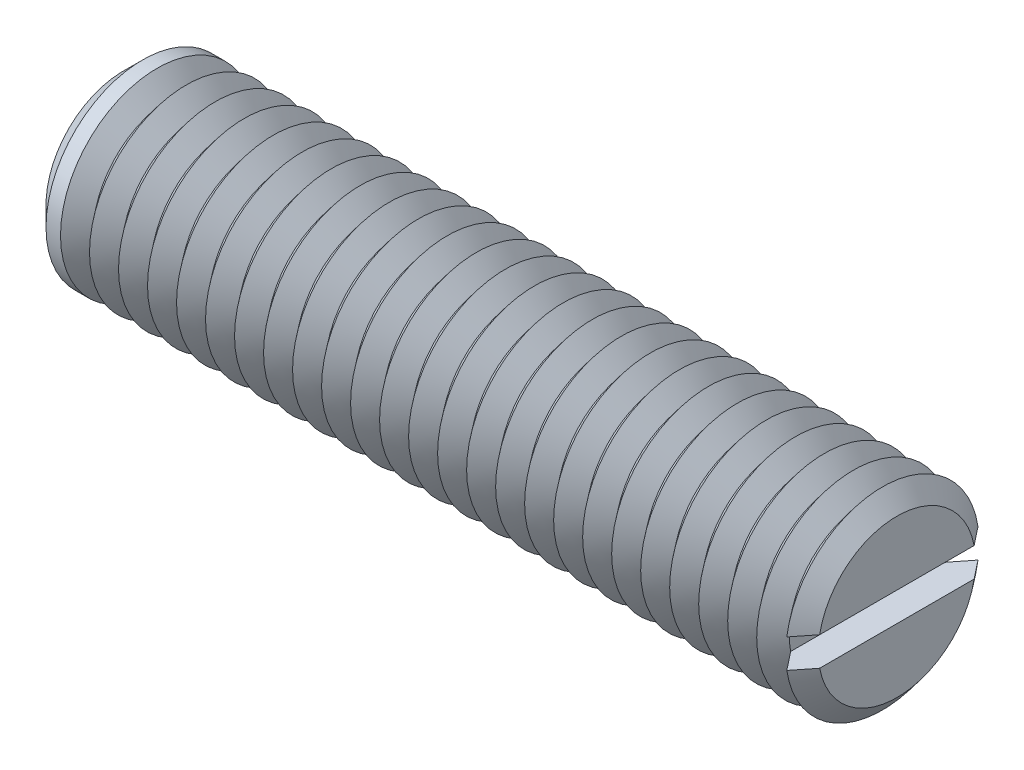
ISO-10303-21;
HEADER;
FILE_DESCRIPTION(('STEP AP214'),'2;1');
FILE_NAME('part.step','',(''),(''),'','','');
FILE_SCHEMA(('AUTOMOTIVE_DESIGN { 1 0 10303 214 1 1 1 1 }'));
ENDSEC;
DATA;
#1=APPLICATION_CONTEXT('core data for automotive mechanical design processes');
#2=APPLICATION_PROTOCOL_DEFINITION('international standard','automotive_design',2000,#1);
#3=PRODUCT_CONTEXT('',#1,'mechanical');
#4=PRODUCT('Part','Part','',(#3));
#5=PRODUCT_RELATED_PRODUCT_CATEGORY('part','',(#4));
#6=PRODUCT_DEFINITION_FORMATION('','',#4);
#7=PRODUCT_DEFINITION_CONTEXT('part definition',#1,'design');
#8=PRODUCT_DEFINITION('design','',#6,#7);
#9=PRODUCT_DEFINITION_SHAPE('','',#8);
#10=(LENGTH_UNIT() NAMED_UNIT(*) SI_UNIT(.MILLI.,.METRE.));
#11=(NAMED_UNIT(*) PLANE_ANGLE_UNIT() SI_UNIT($,.RADIAN.));
#12=(NAMED_UNIT(*) SI_UNIT($,.STERADIAN.) SOLID_ANGLE_UNIT());
#13=UNCERTAINTY_MEASURE_WITH_UNIT(LENGTH_MEASURE(1.E-05),#10,'distance_accuracy_value','');
#14=(GEOMETRIC_REPRESENTATION_CONTEXT(3) GLOBAL_UNCERTAINTY_ASSIGNED_CONTEXT((#13)) GLOBAL_UNIT_ASSIGNED_CONTEXT((#10,
#11,#12)) REPRESENTATION_CONTEXT('',''));
#15=CARTESIAN_POINT('',(0.,0.,0.));
#16=DIRECTION('',(0.,0.,1.));
#17=DIRECTION('',(1.,0.,0.));
#18=AXIS2_PLACEMENT_3D('',#15,#16,#17);
#19=CARTESIAN_POINT('',(19.25,0.,0.));
#20=DIRECTION('',(1.,0.,0.));
#21=DIRECTION('',(0.,0.,-1.));
#22=AXIS2_PLACEMENT_3D('',#19,#20,#21);
#23=CONICAL_SURFACE('',#22,5.,0.895664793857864);
#24=CARTESIAN_POINT('',(19.25,0.,0.));
#25=DIRECTION('',(-1.,0.,0.));
#26=DIRECTION('',(0.,0.,1.));
#27=AXIS2_PLACEMENT_3D('',#24,#25,#26);
#28=CIRCLE('',#27,5.);
#29=CARTESIAN_POINT('',(19.25,-0.75,-4.9434299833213));
#30=VERTEX_POINT('',#29);
#31=CARTESIAN_POINT('',(19.25,-0.75,4.9434299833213));
#32=VERTEX_POINT('',#31);
#33=EDGE_CURVE('E117',#30,#32,#28,.T.);
#34=ORIENTED_EDGE('',*,*,#33,.T.);
#35=CARTESIAN_POINT('',(23.9886555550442,-0.75,-10.8927895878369));
#36=CARTESIAN_POINT('',(23.678663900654,-0.75,-10.5046848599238));
#37=CARTESIAN_POINT('',(23.3687121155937,-0.75,-10.1165482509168));
#38=CARTESIAN_POINT('',(22.7489116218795,-0.75,-9.34012563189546));
#39=CARTESIAN_POINT('',(22.4390629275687,-0.75,-8.95183961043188));
#40=CARTESIAN_POINT('',(21.8189382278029,-0.75,-8.17433811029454));
#41=CARTESIAN_POINT('',(21.5086626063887,-0.75,-7.78512232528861));
#42=CARTESIAN_POINT('',(20.8884400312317,-0.75,-7.00649525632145));
#43=CARTESIAN_POINT('',(20.5784930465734,-0.75,-6.61708399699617));
#44=CARTESIAN_POINT('',(20.1053943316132,-0.75,-6.02191131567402));
#45=CARTESIAN_POINT('',(19.9420627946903,-0.75,-5.81629283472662));
#46=CARTESIAN_POINT('',(19.6155893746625,-0.75,-5.40490151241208));
#47=CARTESIAN_POINT('',(19.4524474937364,-0.75,-5.19912866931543));
#48=CARTESIAN_POINT('',(19.1263799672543,-0.75,-4.78730226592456));
#49=CARTESIAN_POINT('',(18.9634544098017,-0.75,-4.58124863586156));
#50=CARTESIAN_POINT('',(18.638006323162,-0.75,-4.16883695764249));
#51=CARTESIAN_POINT('',(18.4754837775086,-0.75,-3.96247892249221));
#52=CARTESIAN_POINT('',(18.1512888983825,-0.75,-3.54956515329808));
#53=CARTESIAN_POINT('',(17.9896156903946,-0.75,-3.3430101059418));
#54=CARTESIAN_POINT('',(17.6672688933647,-0.75,-2.92906737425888));
#55=CARTESIAN_POINT('',(17.5065954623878,-0.75,-2.72167956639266));
#56=CARTESIAN_POINT('',(17.2671162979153,-0.75,-2.40952296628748));
#57=CARTESIAN_POINT('',(17.187569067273,-0.75,-2.30532351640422));
#58=CARTESIAN_POINT('',(17.0292089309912,-0.75,-2.09636868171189));
#59=CARTESIAN_POINT('',(16.9503960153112,-0.75,-1.99161330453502));
#60=CARTESIAN_POINT('',(16.7939159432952,-0.75,-1.78128982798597));
#61=CARTESIAN_POINT('',(16.7162485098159,-0.75,-1.67572193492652));
#62=CARTESIAN_POINT('',(16.5627483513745,-0.75,-1.46326300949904));
#63=CARTESIAN_POINT('',(16.4869154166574,-0.75,-1.35637213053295));
#64=CARTESIAN_POINT('',(16.3961291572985,-0.75,-1.22407390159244));
#65=CARTESIAN_POINT('',(16.3795740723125,-0.75,-1.19976686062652));
#66=CARTESIAN_POINT('',(16.3466682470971,-0.75,-1.15101442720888));
#67=CARTESIAN_POINT('',(16.3303175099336,-0.75,-1.12656903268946));
#68=CARTESIAN_POINT('',(16.2816161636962,-0.75,-1.05299302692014));
#69=CARTESIAN_POINT('',(16.2496192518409,-0.75,-1.00362669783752));
#70=CARTESIAN_POINT('',(16.1868890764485,-0.75,-0.903957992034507));
#71=CARTESIAN_POINT('',(16.1561584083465,-0.75,-0.853653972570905));
#72=CARTESIAN_POINT('',(16.0966309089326,-0.75,-0.751913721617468));
#73=CARTESIAN_POINT('',(16.0678337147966,-0.75,-0.700477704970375));
#74=CARTESIAN_POINT('',(16.0225435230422,-0.75,-0.613963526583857));
#75=CARTESIAN_POINT('',(16.0052186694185,-0.75,-0.579327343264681));
#76=CARTESIAN_POINT('',(15.9722687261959,-0.75,-0.509265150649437));
#77=CARTESIAN_POINT('',(15.9566439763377,-0.75,-0.473838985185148));
#78=CARTESIAN_POINT('',(15.9132659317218,-0.75,-0.366382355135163));
#79=CARTESIAN_POINT('',(15.8888237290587,-0.75,-0.29284290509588));
#80=CARTESIAN_POINT('',(15.8658405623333,-0.75,-0.189809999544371));
#81=CARTESIAN_POINT('',(15.8606856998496,-0.75,-0.161782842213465));
#82=CARTESIAN_POINT('',(15.8527704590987,-0.75,-0.105398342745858));
#83=CARTESIAN_POINT('',(15.8500088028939,-0.75,-0.0770411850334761));
#84=CARTESIAN_POINT('',(15.8470684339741,-0.75,-0.0202548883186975));
#85=CARTESIAN_POINT('',(15.8468839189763,-0.75,0.00817394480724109));
#86=CARTESIAN_POINT('',(15.8490950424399,-0.75,0.0649322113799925));
#87=CARTESIAN_POINT('',(15.851491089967,-0.75,0.0932616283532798));
#88=CARTESIAN_POINT('',(15.8596937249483,-0.75,0.157351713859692));
#89=CARTESIAN_POINT('',(15.8662565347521,-0.75,0.19301541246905));
#90=CARTESIAN_POINT('',(15.8827020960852,-0.75,0.263573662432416));
#91=CARTESIAN_POINT('',(15.8925874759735,-0.75,0.298467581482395));
#92=CARTESIAN_POINT('',(15.9150598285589,-0.75,0.367652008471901));
#93=CARTESIAN_POINT('',(15.9276667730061,-0.75,0.401935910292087));
#94=CARTESIAN_POINT('',(15.9549130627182,-0.75,0.469664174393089));
#95=CARTESIAN_POINT('',(15.9695519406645,-0.75,0.503108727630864));
#96=CARTESIAN_POINT('',(16.0166350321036,-0.75,0.604259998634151));
#97=CARTESIAN_POINT('',(16.051542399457,-0.75,0.670810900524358));
#98=CARTESIAN_POINT('',(16.1250588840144,-0.75,0.801849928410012));
#99=CARTESIAN_POINT('',(16.1636717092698,-0.75,0.866335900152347));
#100=CARTESIAN_POINT('',(16.2432739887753,-0.75,0.994050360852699));
#101=CARTESIAN_POINT('',(16.2842693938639,-0.75,1.05727512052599));
#102=CARTESIAN_POINT('',(16.3677403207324,-0.75,1.18274150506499));
#103=CARTESIAN_POINT('',(16.4102160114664,-0.75,1.24498301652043));
#104=CARTESIAN_POINT('',(16.4963066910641,-0.75,1.36895722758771));
#105=CARTESIAN_POINT('',(16.5399248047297,-0.75,1.43068775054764));
#106=CARTESIAN_POINT('',(16.6278819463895,-0.75,1.55364126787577));
#107=CARTESIAN_POINT('',(16.672221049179,-0.75,1.61486420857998));
#108=CARTESIAN_POINT('',(16.7613408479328,-0.75,1.73681254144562));
#109=CARTESIAN_POINT('',(16.8061205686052,-0.75,1.79753864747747));
#110=CARTESIAN_POINT('',(16.8960732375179,-0.75,1.91869503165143));
#111=CARTESIAN_POINT('',(16.9412461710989,-0.75,1.97912532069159));
#112=CARTESIAN_POINT('',(17.076109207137,-0.75,2.1586036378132));
#113=CARTESIAN_POINT('',(17.1662359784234,-0.75,2.27732336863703));
#114=CARTESIAN_POINT('',(17.3472315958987,-0.75,2.51419617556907));
#115=CARTESIAN_POINT('',(17.4381004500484,-0.75,2.63234924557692));
#116=CARTESIAN_POINT('',(17.7114512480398,-0.75,2.98624879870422));
#117=CARTESIAN_POINT('',(17.8946699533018,-0.75,3.22142577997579));
#118=CARTESIAN_POINT('',(18.262238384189,-0.75,3.69117947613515));
#119=CARTESIAN_POINT('',(18.4465888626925,-0.75,3.92575559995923));
#120=CARTESIAN_POINT('',(18.81587911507,-0.75,4.39443534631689));
#121=CARTESIAN_POINT('',(19.000818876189,-0.75,4.6285389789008));
#122=CARTESIAN_POINT('',(19.370331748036,-0.75,5.09551589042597));
#123=CARTESIAN_POINT('',(19.5549033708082,-0.75,5.32839034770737));
#124=CARTESIAN_POINT('',(19.9242990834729,-0.75,5.79394105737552));
#125=CARTESIAN_POINT('',(20.1091231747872,-0.75,6.02661730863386));
#126=CARTESIAN_POINT('',(20.6637745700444,-0.75,6.72433690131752));
#127=CARTESIAN_POINT('',(21.0338620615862,-0.75,7.18917337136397));
#128=CARTESIAN_POINT('',(21.6190458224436,-0.75,7.92356230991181));
#129=CARTESIAN_POINT('',(21.8340169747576,-0.75,8.19321453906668));
#130=CARTESIAN_POINT('',(22.2640698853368,-0.75,8.73245662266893));
#131=CARTESIAN_POINT('',(22.479151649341,-0.75,9.00204647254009));
#132=CARTESIAN_POINT('',(22.9099436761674,-0.75,9.54186292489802));
#133=CARTESIAN_POINT('',(23.1256541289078,-0.75,9.81208937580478));
#134=CARTESIAN_POINT('',(23.5571210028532,-0.75,10.3524795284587));
#135=CARTESIAN_POINT('',(23.7728774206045,-0.75,10.6226432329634));
#136=CARTESIAN_POINT('',(23.9886555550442,-0.75,10.8927895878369));
#137=B_SPLINE_CURVE_WITH_KNOTS('',3,(#35,#36,#37,#38,#39,#40,#41,#42,#43,#44,#45,#46,#47,#48,
#49,#50,#51,#52,#53,#54,#55,#56,#57,#58,#59,#60,#61,#62,#63,#64,#65,#66,#67,#68,#69,#70,#71,#72,
#73,#74,#75,#76,#77,#78,#79,#80,#81,#82,#83,#84,#85,#86,#87,#88,#89,#90,#91,#92,#93,#94,#95,#96,
#97,#98,#99,#100,#101,#102,#103,#104,#105,#106,#107,#108,#109,#110,#111,#112,#113,#114,#115,
#116,#117,#118,#119,#120,#121,#122,#123,#124,#125,#126,#127,#128,#129,#130,#131,#132,#133,#134,
#135,#136),.UNSPECIFIED.,.F.,.F.,(4,2,2,2,2,2,2,2,2,2,2,2,2,2,2,2,2,2,2,2,2,2,2,2,2,2,2,2,2,2,2,
2,2,2,2,2,2,2,2,2,2,2,2,2,2,2,2,2,2,2,4),(0.,1.49012787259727,2.98041311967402,4.47367759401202,
5.96678625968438,6.75457128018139,7.5423652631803,8.3304167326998,9.11843545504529,
9.90534542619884,10.6923767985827,11.0856530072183,11.4789238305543,11.8720978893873,
12.265226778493,12.3534535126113,12.441681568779,12.6181526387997,12.7949690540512,
12.9717521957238,13.0878863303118,13.2040436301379,13.43522465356,13.5206311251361,
13.6059919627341,13.6911605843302,13.7763427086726,13.8849305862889,13.9936045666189,
14.1031049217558,14.2125801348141,14.4377857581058,14.6632191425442,14.8892420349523,
15.1152908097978,15.3420406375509,15.5688141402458,15.795165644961,16.0215087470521,
16.4686664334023,16.91582892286,17.8101909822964,18.7052318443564,19.6002534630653,
20.4916985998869,21.3831487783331,23.1656575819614,24.2002223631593,25.2348477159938,
26.2721422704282,27.3093757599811),.UNSPECIFIED.);
#138=CARTESIAN_POINT('',(18.5,-0.75,3.99343248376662));
#139=VERTEX_POINT('',#138);
#140=EDGE_CURVE('E109',#139,#32,#137,.T.);
#141=ORIENTED_EDGE('',*,*,#140,.F.);
#142=CARTESIAN_POINT('',(18.5,0.,0.));
#143=DIRECTION('',(-1.,0.,0.));
#144=DIRECTION('',(0.,0.,1.));
#145=AXIS2_PLACEMENT_3D('',#142,#143,#144);
#146=CIRCLE('',#145,4.06325030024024);
#147=CARTESIAN_POINT('',(18.5,-0.75,-3.99343248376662));
#148=VERTEX_POINT('',#147);
#149=EDGE_CURVE('E423',#148,#139,#146,.T.);
#150=ORIENTED_EDGE('',*,*,#149,.F.);
#151=EDGE_CURVE('E58',#30,#148,#137,.T.);
#152=ORIENTED_EDGE('',*,*,#151,.F.);
#153=EDGE_LOOP('',(#34,#141,#150,#152));
#154=FACE_BOUND('',#153,.T.);
#155=ADVANCED_FACE('F37',(#154),#23,.T.);
#156=CARTESIAN_POINT('',(19.25,0.75,4.9434299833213));
#157=VERTEX_POINT('',#156);
#158=CARTESIAN_POINT('',(19.25,0.75,-4.9434299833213));
#159=VERTEX_POINT('',#158);
#160=EDGE_CURVE('E100',#157,#159,#28,.T.);
#161=ORIENTED_EDGE('',*,*,#160,.T.);
#162=CARTESIAN_POINT('',(23.9886555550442,0.75,10.8927895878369));
#163=CARTESIAN_POINT('',(23.678663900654,0.75,10.5046848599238));
#164=CARTESIAN_POINT('',(23.3687121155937,0.75,10.1165482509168));
#165=CARTESIAN_POINT('',(22.7489116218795,0.75,9.34012563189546));
#166=CARTESIAN_POINT('',(22.4390629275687,0.75,8.95183961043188));
#167=CARTESIAN_POINT('',(21.8189382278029,0.75,8.17433811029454));
#168=CARTESIAN_POINT('',(21.5086626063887,0.75,7.78512232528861));
#169=CARTESIAN_POINT('',(20.8884400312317,0.75,7.00649525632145));
#170=CARTESIAN_POINT('',(20.5784930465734,0.75,6.61708399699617));
#171=CARTESIAN_POINT('',(20.1053943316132,0.75,6.02191131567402));
#172=CARTESIAN_POINT('',(19.9420627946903,0.75,5.81629283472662));
#173=CARTESIAN_POINT('',(19.6155893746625,0.75,5.40490151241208));
#174=CARTESIAN_POINT('',(19.4524474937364,0.75,5.19912866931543));
#175=CARTESIAN_POINT('',(19.1263799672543,0.75,4.78730226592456));
#176=CARTESIAN_POINT('',(18.9634544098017,0.75,4.58124863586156));
#177=CARTESIAN_POINT('',(18.638006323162,0.75,4.16883695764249));
#178=CARTESIAN_POINT('',(18.4754837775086,0.75,3.96247892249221));
#179=CARTESIAN_POINT('',(18.1512888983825,0.75,3.54956515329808));
#180=CARTESIAN_POINT('',(17.9896156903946,0.75,3.3430101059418));
#181=CARTESIAN_POINT('',(17.6672688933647,0.75,2.92906737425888));
#182=CARTESIAN_POINT('',(17.5065954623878,0.75,2.72167956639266));
#183=CARTESIAN_POINT('',(17.2671162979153,0.75,2.40952296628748));
#184=CARTESIAN_POINT('',(17.187569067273,0.75,2.30532351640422));
#185=CARTESIAN_POINT('',(17.0292089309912,0.75,2.09636868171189));
#186=CARTESIAN_POINT('',(16.9503960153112,0.75,1.99161330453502));
#187=CARTESIAN_POINT('',(16.7939159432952,0.75,1.78128982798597));
#188=CARTESIAN_POINT('',(16.7162485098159,0.75,1.67572193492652));
#189=CARTESIAN_POINT('',(16.5627483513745,0.75,1.46326300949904));
#190=CARTESIAN_POINT('',(16.4869154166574,0.75,1.35637213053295));
#191=CARTESIAN_POINT('',(16.3961291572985,0.75,1.22407390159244));
#192=CARTESIAN_POINT('',(16.3795740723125,0.75,1.19976686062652));
#193=CARTESIAN_POINT('',(16.3466682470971,0.75,1.15101442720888));
#194=CARTESIAN_POINT('',(16.3303175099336,0.75,1.12656903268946));
#195=CARTESIAN_POINT('',(16.2816161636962,0.75,1.05299302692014));
#196=CARTESIAN_POINT('',(16.2496192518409,0.75,1.00362669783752));
#197=CARTESIAN_POINT('',(16.1868890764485,0.75,0.903957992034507));
#198=CARTESIAN_POINT('',(16.1561584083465,0.75,0.853653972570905));
#199=CARTESIAN_POINT('',(16.0966309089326,0.75,0.751913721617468));
#200=CARTESIAN_POINT('',(16.0678337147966,0.75,0.700477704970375));
#201=CARTESIAN_POINT('',(16.0225435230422,0.75,0.613963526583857));
#202=CARTESIAN_POINT('',(16.0052186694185,0.75,0.579327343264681));
#203=CARTESIAN_POINT('',(15.9722687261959,0.75,0.509265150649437));
#204=CARTESIAN_POINT('',(15.9566439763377,0.75,0.473838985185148));
#205=CARTESIAN_POINT('',(15.9132659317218,0.75,0.366382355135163));
#206=CARTESIAN_POINT('',(15.8888237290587,0.75,0.29284290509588));
#207=CARTESIAN_POINT('',(15.8658405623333,0.75,0.189809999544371));
#208=CARTESIAN_POINT('',(15.8606856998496,0.75,0.161782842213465));
#209=CARTESIAN_POINT('',(15.8527704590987,0.75,0.105398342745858));
#210=CARTESIAN_POINT('',(15.8500088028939,0.75,0.0770411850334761));
#211=CARTESIAN_POINT('',(15.8470684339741,0.75,0.0202548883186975));
#212=CARTESIAN_POINT('',(15.8468839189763,0.75,-0.00817394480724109));
#213=CARTESIAN_POINT('',(15.8490950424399,0.75,-0.0649322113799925));
#214=CARTESIAN_POINT('',(15.851491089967,0.75,-0.0932616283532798));
#215=CARTESIAN_POINT('',(15.8596937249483,0.75,-0.157351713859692));
#216=CARTESIAN_POINT('',(15.8662565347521,0.75,-0.19301541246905));
#217=CARTESIAN_POINT('',(15.8827020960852,0.75,-0.263573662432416));
#218=CARTESIAN_POINT('',(15.8925874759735,0.75,-0.298467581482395));
#219=CARTESIAN_POINT('',(15.9150598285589,0.75,-0.367652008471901));
#220=CARTESIAN_POINT('',(15.9276667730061,0.75,-0.401935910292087));
#221=CARTESIAN_POINT('',(15.9549130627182,0.75,-0.469664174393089));
#222=CARTESIAN_POINT('',(15.9695519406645,0.75,-0.503108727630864));
#223=CARTESIAN_POINT('',(16.0166350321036,0.75,-0.604259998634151));
#224=CARTESIAN_POINT('',(16.051542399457,0.75,-0.670810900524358));
#225=CARTESIAN_POINT('',(16.1250588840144,0.75,-0.801849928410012));
#226=CARTESIAN_POINT('',(16.1636717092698,0.75,-0.866335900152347));
#227=CARTESIAN_POINT('',(16.2432739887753,0.75,-0.994050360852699));
#228=CARTESIAN_POINT('',(16.2842693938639,0.75,-1.05727512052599));
#229=CARTESIAN_POINT('',(16.3677403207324,0.75,-1.18274150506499));
#230=CARTESIAN_POINT('',(16.4102160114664,0.75,-1.24498301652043));
#231=CARTESIAN_POINT('',(16.4963066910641,0.75,-1.36895722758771));
#232=CARTESIAN_POINT('',(16.5399248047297,0.75,-1.43068775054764));
#233=CARTESIAN_POINT('',(16.6278819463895,0.75,-1.55364126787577));
#234=CARTESIAN_POINT('',(16.672221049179,0.75,-1.61486420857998));
#235=CARTESIAN_POINT('',(16.7613408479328,0.75,-1.73681254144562));
#236=CARTESIAN_POINT('',(16.8061205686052,0.75,-1.79753864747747));
#237=CARTESIAN_POINT('',(16.8960732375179,0.75,-1.91869503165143));
#238=CARTESIAN_POINT('',(16.9412461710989,0.75,-1.97912532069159));
#239=CARTESIAN_POINT('',(17.076109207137,0.75,-2.1586036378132));
#240=CARTESIAN_POINT('',(17.1662359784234,0.75,-2.27732336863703));
#241=CARTESIAN_POINT('',(17.3472315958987,0.75,-2.51419617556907));
#242=CARTESIAN_POINT('',(17.4381004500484,0.75,-2.63234924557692));
#243=CARTESIAN_POINT('',(17.7114512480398,0.75,-2.98624879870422));
#244=CARTESIAN_POINT('',(17.8946699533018,0.75,-3.22142577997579));
#245=CARTESIAN_POINT('',(18.262238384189,0.75,-3.69117947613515));
#246=CARTESIAN_POINT('',(18.4465888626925,0.75,-3.92575559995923));
#247=CARTESIAN_POINT('',(18.81587911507,0.75,-4.39443534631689));
#248=CARTESIAN_POINT('',(19.000818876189,0.75,-4.6285389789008));
#249=CARTESIAN_POINT('',(19.370331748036,0.75,-5.09551589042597));
#250=CARTESIAN_POINT('',(19.5549033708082,0.75,-5.32839034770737));
#251=CARTESIAN_POINT('',(19.9242990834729,0.75,-5.79394105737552));
#252=CARTESIAN_POINT('',(20.1091231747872,0.75,-6.02661730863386));
#253=CARTESIAN_POINT('',(20.6637745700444,0.75,-6.72433690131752));
#254=CARTESIAN_POINT('',(21.0338620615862,0.75,-7.18917337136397));
#255=CARTESIAN_POINT('',(21.6190458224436,0.75,-7.92356230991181));
#256=CARTESIAN_POINT('',(21.8340169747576,0.75,-8.19321453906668));
#257=CARTESIAN_POINT('',(22.2640698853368,0.75,-8.73245662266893));
#258=CARTESIAN_POINT('',(22.479151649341,0.75,-9.00204647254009));
#259=CARTESIAN_POINT('',(22.9099436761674,0.75,-9.54186292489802));
#260=CARTESIAN_POINT('',(23.1256541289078,0.75,-9.81208937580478));
#261=CARTESIAN_POINT('',(23.5571210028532,0.75,-10.3524795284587));
#262=CARTESIAN_POINT('',(23.7728774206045,0.75,-10.6226432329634));
#263=CARTESIAN_POINT('',(23.9886555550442,0.75,-10.8927895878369));
#264=B_SPLINE_CURVE_WITH_KNOTS('',3,(#162,#163,#164,#165,#166,#167,#168,#169,#170,#171,#172,
#173,#174,#175,#176,#177,#178,#179,#180,#181,#182,#183,#184,#185,#186,#187,#188,#189,#190,#191,
#192,#193,#194,#195,#196,#197,#198,#199,#200,#201,#202,#203,#204,#205,#206,#207,#208,#209,#210,
#211,#212,#213,#214,#215,#216,#217,#218,#219,#220,#221,#222,#223,#224,#225,#226,#227,#228,#229,
#230,#231,#232,#233,#234,#235,#236,#237,#238,#239,#240,#241,#242,#243,#244,#245,#246,#247,#248,
#249,#250,#251,#252,#253,#254,#255,#256,#257,#258,#259,#260,#261,#262,#263),.UNSPECIFIED.,.F.,
.F.,(4,2,2,2,2,2,2,2,2,2,2,2,2,2,2,2,2,2,2,2,2,2,2,2,2,2,2,2,2,2,2,2,2,2,2,2,2,2,2,2,2,2,2,2,2,
2,2,2,2,2,4),(0.,1.49012787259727,2.98041311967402,4.47367759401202,5.96678625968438,
6.75457128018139,7.5423652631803,8.3304167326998,9.11843545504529,9.90534542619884,
10.6923767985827,11.0856530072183,11.4789238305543,11.8720978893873,12.265226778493,
12.3534535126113,12.441681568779,12.6181526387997,12.7949690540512,12.9717521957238,
13.0878863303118,13.2040436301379,13.43522465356,13.5206311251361,13.6059919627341,
13.6911605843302,13.7763427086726,13.8849305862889,13.9936045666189,14.1031049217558,
14.2125801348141,14.4377857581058,14.6632191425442,14.8892420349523,15.1152908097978,
15.3420406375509,15.5688141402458,15.795165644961,16.0215087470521,16.4686664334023,
16.91582892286,17.8101909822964,18.7052318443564,19.6002534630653,20.4916985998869,
21.3831487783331,23.1656575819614,24.2002223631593,25.2348477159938,26.2721422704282,
27.3093757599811),.UNSPECIFIED.);
#265=CARTESIAN_POINT('',(18.5,0.75,-3.99343248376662));
#266=VERTEX_POINT('',#265);
#267=EDGE_CURVE('E110',#266,#159,#264,.T.);
#268=ORIENTED_EDGE('',*,*,#267,.F.);
#269=CARTESIAN_POINT('',(18.5,0.75,3.99343248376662));
#270=VERTEX_POINT('',#269);
#271=EDGE_CURVE('E103',#270,#266,#146,.T.);
#272=ORIENTED_EDGE('',*,*,#271,.F.);
#273=EDGE_CURVE('E97',#157,#270,#264,.T.);
#274=ORIENTED_EDGE('',*,*,#273,.F.);
#275=EDGE_LOOP('',(#161,#268,#272,#274));
#276=FACE_BOUND('',#275,.T.);
#277=ADVANCED_FACE('F99',(#276),#23,.T.);
#278=CARTESIAN_POINT('',(18.5,0.,0.));
#279=DIRECTION('',(-1.,0.,0.));
#280=DIRECTION('',(0.,0.,1.));
#281=AXIS2_PLACEMENT_3D('',#278,#279,#280);
#282=CONICAL_SURFACE('',#281,4.06325030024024,0.895664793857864);
#283=CARTESIAN_POINT('',(17.75,0.,0.));
#284=DIRECTION('',(-1.,0.,0.));
#285=DIRECTION('',(0.,0.,1.));
#286=AXIS2_PLACEMENT_3D('',#283,#284,#285);
#287=CIRCLE('',#286,5.);
#288=CARTESIAN_POINT('',(17.75,0.,5.));
#289=VERTEX_POINT('',#288);
#290=EDGE_CURVE('E408',#289,#289,#287,.T.);
#291=ORIENTED_EDGE('',*,*,#290,.F.);
#292=EDGE_LOOP('',(#291));
#293=FACE_BOUND('',#292,.T.);
#294=ORIENTED_EDGE('',*,*,#271,.T.);
#295=EDGE_CURVE('E417',#266,#148,#146,.T.);
#296=ORIENTED_EDGE('',*,*,#295,.T.);
#297=ORIENTED_EDGE('',*,*,#149,.T.);
#298=EDGE_CURVE('E415',#139,#270,#146,.T.);
#299=ORIENTED_EDGE('',*,*,#298,.T.);
#300=EDGE_LOOP('',(#294,#296,#297,#299));
#301=FACE_BOUND('',#300,.T.);
#302=ADVANCED_FACE('F166',(#293,#301),#282,.T.);
#303=CARTESIAN_POINT('',(20.,0.,0.));
#304=DIRECTION('',(1.,0.,0.));
#305=DIRECTION('',(0.,0.,-1.));
#306=AXIS2_PLACEMENT_3D('',#303,#304,#305);
#307=PLANE('',#306);
#308=CARTESIAN_POINT('',(20.,0.,0.));
#309=DIRECTION('',(-1.,0.,0.));
#310=DIRECTION('',(0.,0.,1.));
#311=AXIS2_PLACEMENT_3D('',#308,#309,#310);
#312=CIRCLE('',#311,4.06325030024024);
#313=CARTESIAN_POINT('',(20.,0.75,3.99343248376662));
#314=VERTEX_POINT('',#313);
#315=CARTESIAN_POINT('',(20.,0.75,-3.99343248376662));
#316=VERTEX_POINT('',#315);
#317=EDGE_CURVE('E158',#314,#316,#312,.T.);
#318=ORIENTED_EDGE('',*,*,#317,.F.);
#319=DIRECTION('',(0.,0.,1.));
#320=VECTOR('',#319,1.);
#321=CARTESIAN_POINT('',(20.,0.75,0.));
#322=LINE('',#321,#320);
#323=EDGE_CURVE('E122',#316,#314,#322,.T.);
#324=ORIENTED_EDGE('',*,*,#323,.F.);
#325=EDGE_LOOP('',(#318,#324));
#326=FACE_BOUND('',#325,.T.);
#327=ADVANCED_FACE('F170',(#326),#307,.T.);
#328=CARTESIAN_POINT('',(20.,-0.75,-3.99343248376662));
#329=VERTEX_POINT('',#328);
#330=CARTESIAN_POINT('',(20.,-0.75,3.99343248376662));
#331=VERTEX_POINT('',#330);
#332=EDGE_CURVE('E66',#329,#331,#312,.T.);
#333=ORIENTED_EDGE('',*,*,#332,.F.);
#334=DIRECTION('',(0.,0.,-1.));
#335=VECTOR('',#334,1.);
#336=CARTESIAN_POINT('',(20.,-0.75,0.));
#337=LINE('',#336,#335);
#338=EDGE_CURVE('E135',#331,#329,#337,.T.);
#339=ORIENTED_EDGE('',*,*,#338,.F.);
#340=EDGE_LOOP('',(#333,#339));
#341=FACE_BOUND('',#340,.T.);
#342=ADVANCED_FACE('F201',(#341),#307,.T.);
#343=CARTESIAN_POINT('',(20.,0.,0.));
#344=DIRECTION('',(-1.,0.,0.));
#345=DIRECTION('',(0.,0.,1.));
#346=AXIS2_PLACEMENT_3D('',#343,#344,#345);
#347=CONICAL_SURFACE('',#346,4.06325030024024,0.895664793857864);
#348=ORIENTED_EDGE('',*,*,#160,.F.);
#349=CARTESIAN_POINT('',(14.5113444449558,0.75,-10.8927895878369));
#350=CARTESIAN_POINT('',(14.821336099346,0.75,-10.5046848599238));
#351=CARTESIAN_POINT('',(15.1312878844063,0.75,-10.1165482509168));
#352=CARTESIAN_POINT('',(15.7510883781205,0.75,-9.34012563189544));
#353=CARTESIAN_POINT('',(16.0609370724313,0.75,-8.95183961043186));
#354=CARTESIAN_POINT('',(16.6810617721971,0.75,-8.17433811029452));
#355=CARTESIAN_POINT('',(16.9913373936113,0.75,-7.78512232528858));
#356=CARTESIAN_POINT('',(17.6115599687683,0.75,-7.00649525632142));
#357=CARTESIAN_POINT('',(17.9215069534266,0.75,-6.61708399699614));
#358=CARTESIAN_POINT('',(18.3946056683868,0.75,-6.02191131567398));
#359=CARTESIAN_POINT('',(18.5579372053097,0.75,-5.81629283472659));
#360=CARTESIAN_POINT('',(18.8844106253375,0.75,-5.40490151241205));
#361=CARTESIAN_POINT('',(19.0475525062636,0.75,-5.1991286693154));
#362=CARTESIAN_POINT('',(19.3736200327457,0.75,-4.78730226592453));
#363=CARTESIAN_POINT('',(19.5365455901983,0.75,-4.58124863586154));
#364=CARTESIAN_POINT('',(19.861993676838,0.75,-4.16883695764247));
#365=CARTESIAN_POINT('',(20.0245162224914,0.75,-3.96247892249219));
#366=CARTESIAN_POINT('',(20.3487111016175,0.75,-3.54956515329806));
#367=CARTESIAN_POINT('',(20.5103843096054,0.75,-3.34301010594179));
#368=CARTESIAN_POINT('',(20.8327311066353,0.75,-2.92906737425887));
#369=CARTESIAN_POINT('',(20.9934045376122,0.75,-2.72167956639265));
#370=CARTESIAN_POINT('',(21.2328837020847,0.75,-2.40952296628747));
#371=CARTESIAN_POINT('',(21.312430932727,0.75,-2.30532351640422));
#372=CARTESIAN_POINT('',(21.4707910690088,0.75,-2.09636868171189));
#373=CARTESIAN_POINT('',(21.5496039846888,0.75,-1.99161330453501));
#374=CARTESIAN_POINT('',(21.7060840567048,0.75,-1.78128982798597));
#375=CARTESIAN_POINT('',(21.7837514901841,0.75,-1.67572193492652));
#376=CARTESIAN_POINT('',(21.9372516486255,0.75,-1.46326300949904));
#377=CARTESIAN_POINT('',(22.0130845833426,0.75,-1.35637213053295));
#378=CARTESIAN_POINT('',(22.1038708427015,0.75,-1.22407390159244));
#379=CARTESIAN_POINT('',(22.1204259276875,0.75,-1.19976686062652));
#380=CARTESIAN_POINT('',(22.1533317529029,0.75,-1.15101442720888));
#381=CARTESIAN_POINT('',(22.1696824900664,0.75,-1.12656903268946));
#382=CARTESIAN_POINT('',(22.2183838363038,0.75,-1.05299302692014));
#383=CARTESIAN_POINT('',(22.2503807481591,0.75,-1.00362669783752));
#384=CARTESIAN_POINT('',(22.3131109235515,0.75,-0.903957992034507));
#385=CARTESIAN_POINT('',(22.3438415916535,0.75,-0.853653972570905));
#386=CARTESIAN_POINT('',(22.4033690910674,0.75,-0.751913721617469));
#387=CARTESIAN_POINT('',(22.4321662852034,0.75,-0.700477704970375));
#388=CARTESIAN_POINT('',(22.4774564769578,0.75,-0.613963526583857));
#389=CARTESIAN_POINT('',(22.4947813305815,0.75,-0.579327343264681));
#390=CARTESIAN_POINT('',(22.5277312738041,0.75,-0.509265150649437));
#391=CARTESIAN_POINT('',(22.5433560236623,0.75,-0.473838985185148));
#392=CARTESIAN_POINT('',(22.5867340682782,0.75,-0.366382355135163));
#393=CARTESIAN_POINT('',(22.6111762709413,0.75,-0.292842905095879));
#394=CARTESIAN_POINT('',(22.6341594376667,0.75,-0.18980999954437));
#395=CARTESIAN_POINT('',(22.6393143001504,0.75,-0.161782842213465));
#396=CARTESIAN_POINT('',(22.6472295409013,0.75,-0.105398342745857));
#397=CARTESIAN_POINT('',(22.6499911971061,0.75,-0.0770411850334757));
#398=CARTESIAN_POINT('',(22.6529315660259,0.75,-0.020254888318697));
#399=CARTESIAN_POINT('',(22.6531160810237,0.75,0.00817394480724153));
#400=CARTESIAN_POINT('',(22.6509049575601,0.75,0.064932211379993));
#401=CARTESIAN_POINT('',(22.648508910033,0.75,0.0932616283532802));
#402=CARTESIAN_POINT('',(22.6403062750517,0.75,0.157351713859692));
#403=CARTESIAN_POINT('',(22.6337434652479,0.75,0.193015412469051));
#404=CARTESIAN_POINT('',(22.6172979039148,0.75,0.263573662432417));
#405=CARTESIAN_POINT('',(22.6074125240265,0.75,0.298467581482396));
#406=CARTESIAN_POINT('',(22.5849401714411,0.75,0.367652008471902));
#407=CARTESIAN_POINT('',(22.5723332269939,0.75,0.401935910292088));
#408=CARTESIAN_POINT('',(22.5450869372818,0.75,0.46966417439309));
#409=CARTESIAN_POINT('',(22.5304480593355,0.75,0.503108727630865));
#410=CARTESIAN_POINT('',(22.4833649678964,0.75,0.604259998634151));
#411=CARTESIAN_POINT('',(22.448457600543,0.75,0.670810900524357));
#412=CARTESIAN_POINT('',(22.3749411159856,0.75,0.801849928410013));
#413=CARTESIAN_POINT('',(22.3363282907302,0.75,0.866335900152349));
#414=CARTESIAN_POINT('',(22.2567260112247,0.75,0.994050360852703));
#415=CARTESIAN_POINT('',(22.2157306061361,0.75,1.05727512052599));
#416=CARTESIAN_POINT('',(22.1322596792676,0.75,1.18274150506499));
#417=CARTESIAN_POINT('',(22.0897839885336,0.75,1.24498301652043));
#418=CARTESIAN_POINT('',(22.0036933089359,0.75,1.36895722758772));
#419=CARTESIAN_POINT('',(21.9600751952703,0.75,1.43068775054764));
#420=CARTESIAN_POINT('',(21.8721180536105,0.75,1.55364126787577));
#421=CARTESIAN_POINT('',(21.827778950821,0.75,1.61486420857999));
#422=CARTESIAN_POINT('',(21.7386591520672,0.75,1.73681254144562));
#423=CARTESIAN_POINT('',(21.6938794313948,0.75,1.79753864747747));
#424=CARTESIAN_POINT('',(21.6039267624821,0.75,1.91869503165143));
#425=CARTESIAN_POINT('',(21.5587538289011,0.75,1.97912532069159));
#426=CARTESIAN_POINT('',(21.423890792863,0.75,2.15860363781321));
#427=CARTESIAN_POINT('',(21.3337640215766,0.75,2.27732336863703));
#428=CARTESIAN_POINT('',(21.1527684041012,0.75,2.51419617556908));
#429=CARTESIAN_POINT('',(21.0618995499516,0.75,2.63234924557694));
#430=CARTESIAN_POINT('',(20.7885487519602,0.75,2.98624879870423));
#431=CARTESIAN_POINT('',(20.6053300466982,0.75,3.2214257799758));
#432=CARTESIAN_POINT('',(20.237761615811,0.75,3.69117947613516));
#433=CARTESIAN_POINT('',(20.0534111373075,0.75,3.92575559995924));
#434=CARTESIAN_POINT('',(19.68412088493,0.75,4.3944353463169));
#435=CARTESIAN_POINT('',(19.499181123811,0.75,4.62853897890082));
#436=CARTESIAN_POINT('',(19.129668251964,0.75,5.09551589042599));
#437=CARTESIAN_POINT('',(18.9450966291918,0.75,5.32839034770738));
#438=CARTESIAN_POINT('',(18.5757009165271,0.75,5.79394105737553));
#439=CARTESIAN_POINT('',(18.3908768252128,0.75,6.02661730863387));
#440=CARTESIAN_POINT('',(17.8362254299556,0.75,6.72433690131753));
#441=CARTESIAN_POINT('',(17.4661379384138,0.75,7.18917337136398));
#442=CARTESIAN_POINT('',(16.8809541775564,0.75,7.92356230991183));
#443=CARTESIAN_POINT('',(16.6659830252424,0.75,8.19321453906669));
#444=CARTESIAN_POINT('',(16.2359301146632,0.75,8.73245662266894));
#445=CARTESIAN_POINT('',(16.020848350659,0.75,9.00204647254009));
#446=CARTESIAN_POINT('',(15.5900563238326,0.75,9.54186292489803));
#447=CARTESIAN_POINT('',(15.3743458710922,0.75,9.81208937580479));
#448=CARTESIAN_POINT('',(14.9428789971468,0.75,10.3524795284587));
#449=CARTESIAN_POINT('',(14.7271225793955,0.75,10.6226432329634));
#450=CARTESIAN_POINT('',(14.5113444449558,0.75,10.8927895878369));
#451=B_SPLINE_CURVE_WITH_KNOTS('',3,(#349,#350,#351,#352,#353,#354,#355,#356,#357,#358,#359,
#360,#361,#362,#363,#364,#365,#366,#367,#368,#369,#370,#371,#372,#373,#374,#375,#376,#377,#378,
#379,#380,#381,#382,#383,#384,#385,#386,#387,#388,#389,#390,#391,#392,#393,#394,#395,#396,#397,
#398,#399,#400,#401,#402,#403,#404,#405,#406,#407,#408,#409,#410,#411,#412,#413,#414,#415,#416,
#417,#418,#419,#420,#421,#422,#423,#424,#425,#426,#427,#428,#429,#430,#431,#432,#433,#434,#435,
#436,#437,#438,#439,#440,#441,#442,#443,#444,#445,#446,#447,#448,#449,#450),.UNSPECIFIED.,.F.,
.F.,(4,2,2,2,2,2,2,2,2,2,2,2,2,2,2,2,2,2,2,2,2,2,2,2,2,2,2,2,2,2,2,2,2,2,2,2,2,2,2,2,2,2,2,2,2,
2,2,2,2,2,4),(0.,1.49012787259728,2.98041311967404,4.47367759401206,5.96678625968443,
6.75457128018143,7.54236526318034,8.33041673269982,9.11843545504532,9.90534542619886,
10.6923767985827,11.0856530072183,11.4789238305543,11.8720978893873,12.265226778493,
12.3534535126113,12.441681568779,12.6181526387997,12.7949690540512,12.9717521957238,
13.0878863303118,13.2040436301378,13.43522465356,13.5206311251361,13.605991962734,
13.6911605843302,13.7763427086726,13.8849305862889,13.9936045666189,14.1031049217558,
14.2125801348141,14.4377857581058,14.6632191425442,14.8892420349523,15.1152908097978,
15.3420406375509,15.5688141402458,15.795165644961,16.0215087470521,16.4686664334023,
16.91582892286,17.8101909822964,18.7052318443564,19.6002534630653,20.4916985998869,
21.3831487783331,23.1656575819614,24.2002223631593,25.2348477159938,26.2721422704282,
27.3093757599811),.UNSPECIFIED.);
#452=EDGE_CURVE('E41',#314,#157,#451,.T.);
#453=ORIENTED_EDGE('',*,*,#452,.F.);
#454=ORIENTED_EDGE('',*,*,#317,.T.);
#455=EDGE_CURVE('E11',#159,#316,#451,.T.);
#456=ORIENTED_EDGE('',*,*,#455,.F.);
#457=EDGE_LOOP('',(#348,#453,#454,#456));
#458=FACE_BOUND('',#457,.T.);
#459=ADVANCED_FACE('F114',(#458),#347,.T.);
#460=CARTESIAN_POINT('',(20.,0.75,-7.5));
#461=DIRECTION('',(0.,1.,0.));
#462=DIRECTION('',(0.,0.,1.));
#463=AXIS2_PLACEMENT_3D('',#460,#461,#462);
#464=PLANE('',#463);
#465=ORIENTED_EDGE('',*,*,#452,.T.);
#466=ORIENTED_EDGE('',*,*,#273,.T.);
#467=DIRECTION('',(0.,0.,1.));
#468=VECTOR('',#467,1.);
#469=CARTESIAN_POINT('',(18.5,0.75,-7.5));
#470=LINE('',#469,#468);
#471=EDGE_CURVE('E143',#266,#270,#470,.T.);
#472=ORIENTED_EDGE('',*,*,#471,.F.);
#473=ORIENTED_EDGE('',*,*,#267,.T.);
#474=ORIENTED_EDGE('',*,*,#455,.T.);
#475=ORIENTED_EDGE('',*,*,#323,.T.);
#476=EDGE_LOOP('',(#465,#466,#472,#473,#474,#475));
#477=FACE_BOUND('',#476,.T.);
#478=ADVANCED_FACE('F120',(#477),#464,.F.);
#479=ORIENTED_EDGE('',*,*,#33,.F.);
#480=CARTESIAN_POINT('',(14.5113444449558,-0.75,10.8927895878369));
#481=CARTESIAN_POINT('',(14.821336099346,-0.75,10.5046848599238));
#482=CARTESIAN_POINT('',(15.1312878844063,-0.75,10.1165482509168));
#483=CARTESIAN_POINT('',(15.7510883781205,-0.75,9.34012563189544));
#484=CARTESIAN_POINT('',(16.0609370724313,-0.75,8.95183961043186));
#485=CARTESIAN_POINT('',(16.6810617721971,-0.75,8.17433811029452));
#486=CARTESIAN_POINT('',(16.9913373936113,-0.75,7.78512232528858));
#487=CARTESIAN_POINT('',(17.6115599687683,-0.75,7.00649525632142));
#488=CARTESIAN_POINT('',(17.9215069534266,-0.75,6.61708399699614));
#489=CARTESIAN_POINT('',(18.3946056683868,-0.75,6.02191131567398));
#490=CARTESIAN_POINT('',(18.5579372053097,-0.75,5.81629283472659));
#491=CARTESIAN_POINT('',(18.8844106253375,-0.75,5.40490151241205));
#492=CARTESIAN_POINT('',(19.0475525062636,-0.75,5.1991286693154));
#493=CARTESIAN_POINT('',(19.3736200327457,-0.75,4.78730226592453));
#494=CARTESIAN_POINT('',(19.5365455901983,-0.75,4.58124863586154));
#495=CARTESIAN_POINT('',(19.861993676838,-0.75,4.16883695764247));
#496=CARTESIAN_POINT('',(20.0245162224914,-0.75,3.96247892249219));
#497=CARTESIAN_POINT('',(20.3487111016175,-0.75,3.54956515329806));
#498=CARTESIAN_POINT('',(20.5103843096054,-0.75,3.34301010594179));
#499=CARTESIAN_POINT('',(20.8327311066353,-0.75,2.92906737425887));
#500=CARTESIAN_POINT('',(20.9934045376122,-0.75,2.72167956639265));
#501=CARTESIAN_POINT('',(21.2328837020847,-0.75,2.40952296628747));
#502=CARTESIAN_POINT('',(21.312430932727,-0.75,2.30532351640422));
#503=CARTESIAN_POINT('',(21.4707910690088,-0.75,2.09636868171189));
#504=CARTESIAN_POINT('',(21.5496039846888,-0.75,1.99161330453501));
#505=CARTESIAN_POINT('',(21.7060840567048,-0.75,1.78128982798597));
#506=CARTESIAN_POINT('',(21.7837514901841,-0.75,1.67572193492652));
#507=CARTESIAN_POINT('',(21.9372516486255,-0.75,1.46326300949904));
#508=CARTESIAN_POINT('',(22.0130845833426,-0.75,1.35637213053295));
#509=CARTESIAN_POINT('',(22.1038708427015,-0.75,1.22407390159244));
#510=CARTESIAN_POINT('',(22.1204259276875,-0.75,1.19976686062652));
#511=CARTESIAN_POINT('',(22.1533317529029,-0.75,1.15101442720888));
#512=CARTESIAN_POINT('',(22.1696824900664,-0.75,1.12656903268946));
#513=CARTESIAN_POINT('',(22.2183838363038,-0.75,1.05299302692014));
#514=CARTESIAN_POINT('',(22.2503807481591,-0.75,1.00362669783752));
#515=CARTESIAN_POINT('',(22.3131109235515,-0.75,0.903957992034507));
#516=CARTESIAN_POINT('',(22.3438415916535,-0.75,0.853653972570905));
#517=CARTESIAN_POINT('',(22.4033690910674,-0.75,0.751913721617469));
#518=CARTESIAN_POINT('',(22.4321662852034,-0.75,0.700477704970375));
#519=CARTESIAN_POINT('',(22.4774564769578,-0.75,0.613963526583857));
#520=CARTESIAN_POINT('',(22.4947813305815,-0.75,0.579327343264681));
#521=CARTESIAN_POINT('',(22.5277312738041,-0.75,0.509265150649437));
#522=CARTESIAN_POINT('',(22.5433560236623,-0.75,0.473838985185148));
#523=CARTESIAN_POINT('',(22.5867340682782,-0.75,0.366382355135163));
#524=CARTESIAN_POINT('',(22.6111762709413,-0.75,0.292842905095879));
#525=CARTESIAN_POINT('',(22.6341594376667,-0.75,0.18980999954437));
#526=CARTESIAN_POINT('',(22.6393143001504,-0.75,0.161782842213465));
#527=CARTESIAN_POINT('',(22.6472295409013,-0.75,0.105398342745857));
#528=CARTESIAN_POINT('',(22.6499911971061,-0.75,0.0770411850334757));
#529=CARTESIAN_POINT('',(22.6529315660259,-0.75,0.020254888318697));
#530=CARTESIAN_POINT('',(22.6531160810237,-0.75,-0.00817394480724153));
#531=CARTESIAN_POINT('',(22.6509049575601,-0.75,-0.064932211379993));
#532=CARTESIAN_POINT('',(22.648508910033,-0.75,-0.0932616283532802));
#533=CARTESIAN_POINT('',(22.6403062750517,-0.75,-0.157351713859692));
#534=CARTESIAN_POINT('',(22.6337434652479,-0.75,-0.193015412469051));
#535=CARTESIAN_POINT('',(22.6172979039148,-0.75,-0.263573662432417));
#536=CARTESIAN_POINT('',(22.6074125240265,-0.75,-0.298467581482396));
#537=CARTESIAN_POINT('',(22.5849401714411,-0.75,-0.367652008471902));
#538=CARTESIAN_POINT('',(22.5723332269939,-0.75,-0.401935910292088));
#539=CARTESIAN_POINT('',(22.5450869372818,-0.75,-0.46966417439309));
#540=CARTESIAN_POINT('',(22.5304480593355,-0.75,-0.503108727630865));
#541=CARTESIAN_POINT('',(22.4833649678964,-0.75,-0.604259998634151));
#542=CARTESIAN_POINT('',(22.448457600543,-0.75,-0.670810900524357));
#543=CARTESIAN_POINT('',(22.3749411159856,-0.75,-0.801849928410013));
#544=CARTESIAN_POINT('',(22.3363282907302,-0.75,-0.866335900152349));
#545=CARTESIAN_POINT('',(22.2567260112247,-0.75,-0.994050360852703));
#546=CARTESIAN_POINT('',(22.2157306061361,-0.75,-1.05727512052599));
#547=CARTESIAN_POINT('',(22.1322596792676,-0.75,-1.18274150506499));
#548=CARTESIAN_POINT('',(22.0897839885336,-0.75,-1.24498301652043));
#549=CARTESIAN_POINT('',(22.0036933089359,-0.75,-1.36895722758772));
#550=CARTESIAN_POINT('',(21.9600751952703,-0.75,-1.43068775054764));
#551=CARTESIAN_POINT('',(21.8721180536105,-0.75,-1.55364126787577));
#552=CARTESIAN_POINT('',(21.827778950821,-0.75,-1.61486420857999));
#553=CARTESIAN_POINT('',(21.7386591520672,-0.75,-1.73681254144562));
#554=CARTESIAN_POINT('',(21.6938794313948,-0.75,-1.79753864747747));
#555=CARTESIAN_POINT('',(21.6039267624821,-0.75,-1.91869503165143));
#556=CARTESIAN_POINT('',(21.5587538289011,-0.75,-1.97912532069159));
#557=CARTESIAN_POINT('',(21.423890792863,-0.75,-2.15860363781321));
#558=CARTESIAN_POINT('',(21.3337640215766,-0.75,-2.27732336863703));
#559=CARTESIAN_POINT('',(21.1527684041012,-0.75,-2.51419617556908));
#560=CARTESIAN_POINT('',(21.0618995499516,-0.75,-2.63234924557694));
#561=CARTESIAN_POINT('',(20.7885487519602,-0.75,-2.98624879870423));
#562=CARTESIAN_POINT('',(20.6053300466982,-0.75,-3.2214257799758));
#563=CARTESIAN_POINT('',(20.237761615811,-0.75,-3.69117947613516));
#564=CARTESIAN_POINT('',(20.0534111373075,-0.75,-3.92575559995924));
#565=CARTESIAN_POINT('',(19.68412088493,-0.75,-4.3944353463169));
#566=CARTESIAN_POINT('',(19.499181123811,-0.75,-4.62853897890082));
#567=CARTESIAN_POINT('',(19.129668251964,-0.75,-5.09551589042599));
#568=CARTESIAN_POINT('',(18.9450966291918,-0.75,-5.32839034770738));
#569=CARTESIAN_POINT('',(18.5757009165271,-0.75,-5.79394105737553));
#570=CARTESIAN_POINT('',(18.3908768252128,-0.75,-6.02661730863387));
#571=CARTESIAN_POINT('',(17.8362254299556,-0.75,-6.72433690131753));
#572=CARTESIAN_POINT('',(17.4661379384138,-0.75,-7.18917337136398));
#573=CARTESIAN_POINT('',(16.8809541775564,-0.75,-7.92356230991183));
#574=CARTESIAN_POINT('',(16.6659830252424,-0.75,-8.19321453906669));
#575=CARTESIAN_POINT('',(16.2359301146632,-0.75,-8.73245662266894));
#576=CARTESIAN_POINT('',(16.020848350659,-0.75,-9.00204647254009));
#577=CARTESIAN_POINT('',(15.5900563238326,-0.75,-9.54186292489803));
#578=CARTESIAN_POINT('',(15.3743458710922,-0.75,-9.81208937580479));
#579=CARTESIAN_POINT('',(14.9428789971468,-0.75,-10.3524795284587));
#580=CARTESIAN_POINT('',(14.7271225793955,-0.75,-10.6226432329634));
#581=CARTESIAN_POINT('',(14.5113444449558,-0.75,-10.8927895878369));
#582=B_SPLINE_CURVE_WITH_KNOTS('',3,(#480,#481,#482,#483,#484,#485,#486,#487,#488,#489,#490,
#491,#492,#493,#494,#495,#496,#497,#498,#499,#500,#501,#502,#503,#504,#505,#506,#507,#508,#509,
#510,#511,#512,#513,#514,#515,#516,#517,#518,#519,#520,#521,#522,#523,#524,#525,#526,#527,#528,
#529,#530,#531,#532,#533,#534,#535,#536,#537,#538,#539,#540,#541,#542,#543,#544,#545,#546,#547,
#548,#549,#550,#551,#552,#553,#554,#555,#556,#557,#558,#559,#560,#561,#562,#563,#564,#565,#566,
#567,#568,#569,#570,#571,#572,#573,#574,#575,#576,#577,#578,#579,#580,#581),.UNSPECIFIED.,.F.,
.F.,(4,2,2,2,2,2,2,2,2,2,2,2,2,2,2,2,2,2,2,2,2,2,2,2,2,2,2,2,2,2,2,2,2,2,2,2,2,2,2,2,2,2,2,2,2,
2,2,2,2,2,4),(0.,1.49012787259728,2.98041311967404,4.47367759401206,5.96678625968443,
6.75457128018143,7.54236526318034,8.33041673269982,9.11843545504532,9.90534542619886,
10.6923767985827,11.0856530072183,11.4789238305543,11.8720978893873,12.265226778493,
12.3534535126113,12.441681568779,12.6181526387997,12.7949690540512,12.9717521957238,
13.0878863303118,13.2040436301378,13.43522465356,13.5206311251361,13.605991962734,
13.6911605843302,13.7763427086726,13.8849305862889,13.9936045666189,14.1031049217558,
14.2125801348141,14.4377857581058,14.6632191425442,14.8892420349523,15.1152908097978,
15.3420406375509,15.5688141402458,15.795165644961,16.0215087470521,16.4686664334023,
16.91582892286,17.8101909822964,18.7052318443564,19.6002534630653,20.4916985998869,
21.3831487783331,23.1656575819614,24.2002223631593,25.2348477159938,26.2721422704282,
27.3093757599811),.UNSPECIFIED.);
#583=EDGE_CURVE('E150',#329,#30,#582,.T.);
#584=ORIENTED_EDGE('',*,*,#583,.F.);
#585=ORIENTED_EDGE('',*,*,#332,.T.);
#586=EDGE_CURVE('E146',#32,#331,#582,.T.);
#587=ORIENTED_EDGE('',*,*,#586,.F.);
#588=EDGE_LOOP('',(#479,#584,#585,#587));
#589=FACE_BOUND('',#588,.T.);
#590=ADVANCED_FACE('F162',(#589),#347,.T.);
#591=CARTESIAN_POINT('',(20.,-0.75,-7.5));
#592=DIRECTION('',(0.,-1.,0.));
#593=DIRECTION('',(0.,0.,-1.));
#594=AXIS2_PLACEMENT_3D('',#591,#592,#593);
#595=PLANE('',#594);
#596=ORIENTED_EDGE('',*,*,#583,.T.);
#597=ORIENTED_EDGE('',*,*,#151,.T.);
#598=DIRECTION('',(0.,0.,1.));
#599=VECTOR('',#598,1.);
#600=CARTESIAN_POINT('',(18.5,-0.75,-7.5));
#601=LINE('',#600,#599);
#602=EDGE_CURVE('E142',#148,#139,#601,.T.);
#603=ORIENTED_EDGE('',*,*,#602,.T.);
#604=ORIENTED_EDGE('',*,*,#140,.T.);
#605=ORIENTED_EDGE('',*,*,#586,.T.);
#606=ORIENTED_EDGE('',*,*,#338,.T.);
#607=EDGE_LOOP('',(#596,#597,#603,#604,#605,#606));
#608=FACE_BOUND('',#607,.T.);
#609=ADVANCED_FACE('F159',(#608),#595,.F.);
#610=CARTESIAN_POINT('',(18.5,0.75,-7.5));
#611=DIRECTION('',(-1.,0.,0.));
#612=DIRECTION('',(0.,0.,1.));
#613=AXIS2_PLACEMENT_3D('',#610,#611,#612);
#614=PLANE('',#613);
#615=ORIENTED_EDGE('',*,*,#602,.F.);
#616=ORIENTED_EDGE('',*,*,#295,.F.);
#617=ORIENTED_EDGE('',*,*,#471,.T.);
#618=ORIENTED_EDGE('',*,*,#298,.F.);
#619=EDGE_LOOP('',(#615,#616,#617,#618));
#620=FACE_BOUND('',#619,.T.);
#621=ADVANCED_FACE('F428',(#620),#614,.F.);
#622=CARTESIAN_POINT('',(17.,0.,0.));
#623=DIRECTION('',(-1.,0.,0.));
#624=DIRECTION('',(0.,0.,1.));
#625=AXIS2_PLACEMENT_3D('',#622,#623,#624);
#626=CONICAL_SURFACE('',#625,4.06325030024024,0.895664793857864);
#627=CARTESIAN_POINT('',(16.25,0.,0.));
#628=DIRECTION('',(-1.,0.,0.));
#629=DIRECTION('',(0.,0.,1.));
#630=AXIS2_PLACEMENT_3D('',#627,#628,#629);
#631=CIRCLE('',#630,5.);
#632=CARTESIAN_POINT('',(16.25,0.,5.));
#633=VERTEX_POINT('',#632);
#634=EDGE_CURVE('E400',#633,#633,#631,.T.);
#635=ORIENTED_EDGE('',*,*,#634,.F.);
#636=EDGE_LOOP('',(#635));
#637=FACE_BOUND('',#636,.T.);
#638=CARTESIAN_POINT('',(17.,0.,0.));
#639=DIRECTION('',(-1.,0.,0.));
#640=DIRECTION('',(0.,0.,1.));
#641=AXIS2_PLACEMENT_3D('',#638,#639,#640);
#642=CIRCLE('',#641,4.06325030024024);
#643=CARTESIAN_POINT('',(17.,0.,4.06325030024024));
#644=VERTEX_POINT('',#643);
#645=EDGE_CURVE('E412',#644,#644,#642,.T.);
#646=ORIENTED_EDGE('',*,*,#645,.T.);
#647=EDGE_LOOP('',(#646));
#648=FACE_BOUND('',#647,.T.);
#649=ADVANCED_FACE('F175',(#637,#648),#626,.T.);
#650=CARTESIAN_POINT('',(17.75,0.,0.));
#651=DIRECTION('',(1.,0.,0.));
#652=DIRECTION('',(0.,0.,-1.));
#653=AXIS2_PLACEMENT_3D('',#650,#651,#652);
#654=CONICAL_SURFACE('',#653,5.,0.895664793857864);
#655=ORIENTED_EDGE('',*,*,#645,.F.);
#656=EDGE_LOOP('',(#655));
#657=FACE_BOUND('',#656,.T.);
#658=ORIENTED_EDGE('',*,*,#290,.T.);
#659=EDGE_LOOP('',(#658));
#660=FACE_BOUND('',#659,.T.);
#661=ADVANCED_FACE('F434',(#657,#660),#654,.T.);
#662=CARTESIAN_POINT('',(15.5,0.,0.));
#663=DIRECTION('',(-1.,0.,0.));
#664=DIRECTION('',(0.,0.,1.));
#665=AXIS2_PLACEMENT_3D('',#662,#663,#664);
#666=CONICAL_SURFACE('',#665,4.06325030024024,0.895664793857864);
#667=CARTESIAN_POINT('',(14.75,0.,0.));
#668=DIRECTION('',(-1.,0.,0.));
#669=DIRECTION('',(0.,0.,1.));
#670=AXIS2_PLACEMENT_3D('',#667,#668,#669);
#671=CIRCLE('',#670,5.);
#672=CARTESIAN_POINT('',(14.75,0.,5.));
#673=VERTEX_POINT('',#672);
#674=EDGE_CURVE('E392',#673,#673,#671,.T.);
#675=ORIENTED_EDGE('',*,*,#674,.F.);
#676=EDGE_LOOP('',(#675));
#677=FACE_BOUND('',#676,.T.);
#678=CARTESIAN_POINT('',(15.5,0.,0.));
#679=DIRECTION('',(-1.,0.,0.));
#680=DIRECTION('',(0.,0.,1.));
#681=AXIS2_PLACEMENT_3D('',#678,#679,#680);
#682=CIRCLE('',#681,4.06325030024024);
#683=CARTESIAN_POINT('',(15.5,0.,4.06325030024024));
#684=VERTEX_POINT('',#683);
#685=EDGE_CURVE('E404',#684,#684,#682,.T.);
#686=ORIENTED_EDGE('',*,*,#685,.T.);
#687=EDGE_LOOP('',(#686));
#688=FACE_BOUND('',#687,.T.);
#689=ADVANCED_FACE('F498',(#677,#688),#666,.T.);
#690=CARTESIAN_POINT('',(16.25,0.,0.));
#691=DIRECTION('',(1.,0.,0.));
#692=DIRECTION('',(0.,0.,-1.));
#693=AXIS2_PLACEMENT_3D('',#690,#691,#692);
#694=CONICAL_SURFACE('',#693,5.,0.895664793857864);
#695=ORIENTED_EDGE('',*,*,#685,.F.);
#696=EDGE_LOOP('',(#695));
#697=FACE_BOUND('',#696,.T.);
#698=ORIENTED_EDGE('',*,*,#634,.T.);
#699=EDGE_LOOP('',(#698));
#700=FACE_BOUND('',#699,.T.);
#701=ADVANCED_FACE('F507',(#697,#700),#694,.T.);
#702=CARTESIAN_POINT('',(14.,0.,0.));
#703=DIRECTION('',(-1.,0.,0.));
#704=DIRECTION('',(0.,0.,1.));
#705=AXIS2_PLACEMENT_3D('',#702,#703,#704);
#706=CONICAL_SURFACE('',#705,4.06325030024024,0.895664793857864);
#707=CARTESIAN_POINT('',(13.25,0.,0.));
#708=DIRECTION('',(-1.,0.,0.));
#709=DIRECTION('',(0.,0.,1.));
#710=AXIS2_PLACEMENT_3D('',#707,#708,#709);
#711=CIRCLE('',#710,5.);
#712=CARTESIAN_POINT('',(13.25,0.,5.));
#713=VERTEX_POINT('',#712);
#714=EDGE_CURVE('E385',#713,#713,#711,.T.);
#715=ORIENTED_EDGE('',*,*,#714,.F.);
#716=EDGE_LOOP('',(#715));
#717=FACE_BOUND('',#716,.T.);
#718=CARTESIAN_POINT('',(14.,0.,0.));
#719=DIRECTION('',(-1.,0.,0.));
#720=DIRECTION('',(0.,0.,1.));
#721=AXIS2_PLACEMENT_3D('',#718,#719,#720);
#722=CIRCLE('',#721,4.06325030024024);
#723=CARTESIAN_POINT('',(14.,0.,4.06325030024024));
#724=VERTEX_POINT('',#723);
#725=EDGE_CURVE('E396',#724,#724,#722,.T.);
#726=ORIENTED_EDGE('',*,*,#725,.T.);
#727=EDGE_LOOP('',(#726));
#728=FACE_BOUND('',#727,.T.);
#729=ADVANCED_FACE('F517',(#717,#728),#706,.T.);
#730=CARTESIAN_POINT('',(14.75,0.,0.));
#731=DIRECTION('',(1.,0.,0.));
#732=DIRECTION('',(0.,0.,-1.));
#733=AXIS2_PLACEMENT_3D('',#730,#731,#732);
#734=CONICAL_SURFACE('',#733,5.,0.895664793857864);
#735=ORIENTED_EDGE('',*,*,#725,.F.);
#736=EDGE_LOOP('',(#735));
#737=FACE_BOUND('',#736,.T.);
#738=ORIENTED_EDGE('',*,*,#674,.T.);
#739=EDGE_LOOP('',(#738));
#740=FACE_BOUND('',#739,.T.);
#741=ADVANCED_FACE('F527',(#737,#740),#734,.T.);
#742=CARTESIAN_POINT('',(12.5,0.,0.));
#743=DIRECTION('',(-1.,0.,0.));
#744=DIRECTION('',(0.,0.,1.));
#745=AXIS2_PLACEMENT_3D('',#742,#743,#744);
#746=CONICAL_SURFACE('',#745,4.06325030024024,0.895664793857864);
#747=CARTESIAN_POINT('',(11.75,0.,0.));
#748=DIRECTION('',(-1.,0.,0.));
#749=DIRECTION('',(0.,0.,1.));
#750=AXIS2_PLACEMENT_3D('',#747,#748,#749);
#751=CIRCLE('',#750,5.);
#752=CARTESIAN_POINT('',(11.75,0.,5.));
#753=VERTEX_POINT('',#752);
#754=EDGE_CURVE('E378',#753,#753,#751,.T.);
#755=ORIENTED_EDGE('',*,*,#754,.F.);
#756=EDGE_LOOP('',(#755));
#757=FACE_BOUND('',#756,.T.);
#758=CARTESIAN_POINT('',(12.5,0.,0.));
#759=DIRECTION('',(-1.,0.,0.));
#760=DIRECTION('',(0.,0.,1.));
#761=AXIS2_PLACEMENT_3D('',#758,#759,#760);
#762=CIRCLE('',#761,4.06325030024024);
#763=CARTESIAN_POINT('',(12.5,0.,4.06325030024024));
#764=VERTEX_POINT('',#763);
#765=EDGE_CURVE('E389',#764,#764,#762,.T.);
#766=ORIENTED_EDGE('',*,*,#765,.T.);
#767=EDGE_LOOP('',(#766));
#768=FACE_BOUND('',#767,.T.);
#769=ADVANCED_FACE('F537',(#757,#768),#746,.T.);
#770=CARTESIAN_POINT('',(13.25,0.,0.));
#771=DIRECTION('',(1.,0.,0.));
#772=DIRECTION('',(0.,0.,-1.));
#773=AXIS2_PLACEMENT_3D('',#770,#771,#772);
#774=CONICAL_SURFACE('',#773,5.,0.895664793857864);
#775=ORIENTED_EDGE('',*,*,#765,.F.);
#776=EDGE_LOOP('',(#775));
#777=FACE_BOUND('',#776,.T.);
#778=ORIENTED_EDGE('',*,*,#714,.T.);
#779=EDGE_LOOP('',(#778));
#780=FACE_BOUND('',#779,.T.);
#781=ADVANCED_FACE('F547',(#777,#780),#774,.T.);
#782=CARTESIAN_POINT('',(11.,0.,0.));
#783=DIRECTION('',(-1.,0.,0.));
#784=DIRECTION('',(0.,0.,1.));
#785=AXIS2_PLACEMENT_3D('',#782,#783,#784);
#786=CONICAL_SURFACE('',#785,4.06325030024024,0.895664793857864);
#787=CARTESIAN_POINT('',(10.25,0.,0.));
#788=DIRECTION('',(-1.,0.,0.));
#789=DIRECTION('',(0.,0.,1.));
#790=AXIS2_PLACEMENT_3D('',#787,#788,#789);
#791=CIRCLE('',#790,5.);
#792=CARTESIAN_POINT('',(10.25,0.,5.));
#793=VERTEX_POINT('',#792);
#794=EDGE_CURVE('E370',#793,#793,#791,.T.);
#795=ORIENTED_EDGE('',*,*,#794,.F.);
#796=EDGE_LOOP('',(#795));
#797=FACE_BOUND('',#796,.T.);
#798=CARTESIAN_POINT('',(11.,0.,0.));
#799=DIRECTION('',(-1.,0.,0.));
#800=DIRECTION('',(0.,0.,1.));
#801=AXIS2_PLACEMENT_3D('',#798,#799,#800);
#802=CIRCLE('',#801,4.06325030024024);
#803=CARTESIAN_POINT('',(11.,0.,4.06325030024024));
#804=VERTEX_POINT('',#803);
#805=EDGE_CURVE('E382',#804,#804,#802,.T.);
#806=ORIENTED_EDGE('',*,*,#805,.T.);
#807=EDGE_LOOP('',(#806));
#808=FACE_BOUND('',#807,.T.);
#809=ADVANCED_FACE('F557',(#797,#808),#786,.T.);
#810=CARTESIAN_POINT('',(11.75,0.,0.));
#811=DIRECTION('',(1.,0.,0.));
#812=DIRECTION('',(0.,0.,-1.));
#813=AXIS2_PLACEMENT_3D('',#810,#811,#812);
#814=CONICAL_SURFACE('',#813,5.,0.895664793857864);
#815=ORIENTED_EDGE('',*,*,#805,.F.);
#816=EDGE_LOOP('',(#815));
#817=FACE_BOUND('',#816,.T.);
#818=ORIENTED_EDGE('',*,*,#754,.T.);
#819=EDGE_LOOP('',(#818));
#820=FACE_BOUND('',#819,.T.);
#821=ADVANCED_FACE('F567',(#817,#820),#814,.T.);
#822=CARTESIAN_POINT('',(9.5,0.,0.));
#823=DIRECTION('',(-1.,0.,0.));
#824=DIRECTION('',(0.,0.,1.));
#825=AXIS2_PLACEMENT_3D('',#822,#823,#824);
#826=CONICAL_SURFACE('',#825,4.06325030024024,0.895664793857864);
#827=CARTESIAN_POINT('',(8.75,0.,0.));
#828=DIRECTION('',(-1.,0.,0.));
#829=DIRECTION('',(0.,0.,1.));
#830=AXIS2_PLACEMENT_3D('',#827,#828,#829);
#831=CIRCLE('',#830,5.);
#832=CARTESIAN_POINT('',(8.75,0.,5.));
#833=VERTEX_POINT('',#832);
#834=EDGE_CURVE('E362',#833,#833,#831,.T.);
#835=ORIENTED_EDGE('',*,*,#834,.F.);
#836=EDGE_LOOP('',(#835));
#837=FACE_BOUND('',#836,.T.);
#838=CARTESIAN_POINT('',(9.5,0.,0.));
#839=DIRECTION('',(-1.,0.,0.));
#840=DIRECTION('',(0.,0.,1.));
#841=AXIS2_PLACEMENT_3D('',#838,#839,#840);
#842=CIRCLE('',#841,4.06325030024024);
#843=CARTESIAN_POINT('',(9.5,0.,4.06325030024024));
#844=VERTEX_POINT('',#843);
#845=EDGE_CURVE('E374',#844,#844,#842,.T.);
#846=ORIENTED_EDGE('',*,*,#845,.T.);
#847=EDGE_LOOP('',(#846));
#848=FACE_BOUND('',#847,.T.);
#849=ADVANCED_FACE('F577',(#837,#848),#826,.T.);
#850=CARTESIAN_POINT('',(10.25,0.,0.));
#851=DIRECTION('',(1.,0.,0.));
#852=DIRECTION('',(0.,0.,-1.));
#853=AXIS2_PLACEMENT_3D('',#850,#851,#852);
#854=CONICAL_SURFACE('',#853,5.,0.895664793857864);
#855=ORIENTED_EDGE('',*,*,#845,.F.);
#856=EDGE_LOOP('',(#855));
#857=FACE_BOUND('',#856,.T.);
#858=ORIENTED_EDGE('',*,*,#794,.T.);
#859=EDGE_LOOP('',(#858));
#860=FACE_BOUND('',#859,.T.);
#861=ADVANCED_FACE('F587',(#857,#860),#854,.T.);
#862=CARTESIAN_POINT('',(8.,0.,0.));
#863=DIRECTION('',(-1.,0.,0.));
#864=DIRECTION('',(0.,0.,1.));
#865=AXIS2_PLACEMENT_3D('',#862,#863,#864);
#866=CONICAL_SURFACE('',#865,4.06325030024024,0.895664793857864);
#867=CARTESIAN_POINT('',(7.25,0.,0.));
#868=DIRECTION('',(-1.,0.,0.));
#869=DIRECTION('',(0.,0.,1.));
#870=AXIS2_PLACEMENT_3D('',#867,#868,#869);
#871=CIRCLE('',#870,5.);
#872=CARTESIAN_POINT('',(7.25,0.,5.));
#873=VERTEX_POINT('',#872);
#874=EDGE_CURVE('E355',#873,#873,#871,.T.);
#875=ORIENTED_EDGE('',*,*,#874,.F.);
#876=EDGE_LOOP('',(#875));
#877=FACE_BOUND('',#876,.T.);
#878=CARTESIAN_POINT('',(8.,0.,0.));
#879=DIRECTION('',(-1.,0.,0.));
#880=DIRECTION('',(0.,0.,1.));
#881=AXIS2_PLACEMENT_3D('',#878,#879,#880);
#882=CIRCLE('',#881,4.06325030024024);
#883=CARTESIAN_POINT('',(8.,0.,4.06325030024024));
#884=VERTEX_POINT('',#883);
#885=EDGE_CURVE('E366',#884,#884,#882,.T.);
#886=ORIENTED_EDGE('',*,*,#885,.T.);
#887=EDGE_LOOP('',(#886));
#888=FACE_BOUND('',#887,.T.);
#889=ADVANCED_FACE('F597',(#877,#888),#866,.T.);
#890=CARTESIAN_POINT('',(8.75,0.,0.));
#891=DIRECTION('',(1.,0.,0.));
#892=DIRECTION('',(0.,0.,-1.));
#893=AXIS2_PLACEMENT_3D('',#890,#891,#892);
#894=CONICAL_SURFACE('',#893,5.,0.895664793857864);
#895=ORIENTED_EDGE('',*,*,#885,.F.);
#896=EDGE_LOOP('',(#895));
#897=FACE_BOUND('',#896,.T.);
#898=ORIENTED_EDGE('',*,*,#834,.T.);
#899=EDGE_LOOP('',(#898));
#900=FACE_BOUND('',#899,.T.);
#901=ADVANCED_FACE('F607',(#897,#900),#894,.T.);
#902=CARTESIAN_POINT('',(6.5,0.,0.));
#903=DIRECTION('',(-1.,0.,0.));
#904=DIRECTION('',(0.,0.,1.));
#905=AXIS2_PLACEMENT_3D('',#902,#903,#904);
#906=CONICAL_SURFACE('',#905,4.06325030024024,0.895664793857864);
#907=CARTESIAN_POINT('',(5.75,0.,0.));
#908=DIRECTION('',(-1.,0.,0.));
#909=DIRECTION('',(0.,0.,1.));
#910=AXIS2_PLACEMENT_3D('',#907,#908,#909);
#911=CIRCLE('',#910,5.);
#912=CARTESIAN_POINT('',(5.75,0.,5.));
#913=VERTEX_POINT('',#912);
#914=EDGE_CURVE('E348',#913,#913,#911,.T.);
#915=ORIENTED_EDGE('',*,*,#914,.F.);
#916=EDGE_LOOP('',(#915));
#917=FACE_BOUND('',#916,.T.);
#918=CARTESIAN_POINT('',(6.5,0.,0.));
#919=DIRECTION('',(-1.,0.,0.));
#920=DIRECTION('',(0.,0.,1.));
#921=AXIS2_PLACEMENT_3D('',#918,#919,#920);
#922=CIRCLE('',#921,4.06325030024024);
#923=CARTESIAN_POINT('',(6.5,0.,4.06325030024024));
#924=VERTEX_POINT('',#923);
#925=EDGE_CURVE('E358',#924,#924,#922,.T.);
#926=ORIENTED_EDGE('',*,*,#925,.T.);
#927=EDGE_LOOP('',(#926));
#928=FACE_BOUND('',#927,.T.);
#929=ADVANCED_FACE('F617',(#917,#928),#906,.T.);
#930=CARTESIAN_POINT('',(7.25,0.,0.));
#931=DIRECTION('',(1.,0.,0.));
#932=DIRECTION('',(0.,0.,-1.));
#933=AXIS2_PLACEMENT_3D('',#930,#931,#932);
#934=CONICAL_SURFACE('',#933,5.,0.895664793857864);
#935=ORIENTED_EDGE('',*,*,#925,.F.);
#936=EDGE_LOOP('',(#935));
#937=FACE_BOUND('',#936,.T.);
#938=ORIENTED_EDGE('',*,*,#874,.T.);
#939=EDGE_LOOP('',(#938));
#940=FACE_BOUND('',#939,.T.);
#941=ADVANCED_FACE('F627',(#937,#940),#934,.T.);
#942=CARTESIAN_POINT('',(5.,0.,0.));
#943=DIRECTION('',(-1.,0.,0.));
#944=DIRECTION('',(0.,0.,1.));
#945=AXIS2_PLACEMENT_3D('',#942,#943,#944);
#946=CONICAL_SURFACE('',#945,4.06325030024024,0.895664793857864);
#947=CARTESIAN_POINT('',(4.25,0.,0.));
#948=DIRECTION('',(-1.,0.,0.));
#949=DIRECTION('',(0.,0.,1.));
#950=AXIS2_PLACEMENT_3D('',#947,#948,#949);
#951=CIRCLE('',#950,5.);
#952=CARTESIAN_POINT('',(4.25,0.,5.));
#953=VERTEX_POINT('',#952);
#954=EDGE_CURVE('E341',#953,#953,#951,.T.);
#955=ORIENTED_EDGE('',*,*,#954,.F.);
#956=EDGE_LOOP('',(#955));
#957=FACE_BOUND('',#956,.T.);
#958=CARTESIAN_POINT('',(5.,0.,0.));
#959=DIRECTION('',(-1.,0.,0.));
#960=DIRECTION('',(0.,0.,1.));
#961=AXIS2_PLACEMENT_3D('',#958,#959,#960);
#962=CIRCLE('',#961,4.06325030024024);
#963=CARTESIAN_POINT('',(5.,0.,4.06325030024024));
#964=VERTEX_POINT('',#963);
#965=EDGE_CURVE('E351',#964,#964,#962,.T.);
#966=ORIENTED_EDGE('',*,*,#965,.T.);
#967=EDGE_LOOP('',(#966));
#968=FACE_BOUND('',#967,.T.);
#969=ADVANCED_FACE('F637',(#957,#968),#946,.T.);
#970=CARTESIAN_POINT('',(5.75,0.,0.));
#971=DIRECTION('',(1.,0.,0.));
#972=DIRECTION('',(0.,0.,-1.));
#973=AXIS2_PLACEMENT_3D('',#970,#971,#972);
#974=CONICAL_SURFACE('',#973,5.,0.895664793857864);
#975=ORIENTED_EDGE('',*,*,#965,.F.);
#976=EDGE_LOOP('',(#975));
#977=FACE_BOUND('',#976,.T.);
#978=ORIENTED_EDGE('',*,*,#914,.T.);
#979=EDGE_LOOP('',(#978));
#980=FACE_BOUND('',#979,.T.);
#981=ADVANCED_FACE('F647',(#977,#980),#974,.T.);
#982=CARTESIAN_POINT('',(3.5,0.,0.));
#983=DIRECTION('',(-1.,0.,0.));
#984=DIRECTION('',(0.,0.,1.));
#985=AXIS2_PLACEMENT_3D('',#982,#983,#984);
#986=CONICAL_SURFACE('',#985,4.06325030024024,0.895664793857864);
#987=CARTESIAN_POINT('',(2.75,0.,0.));
#988=DIRECTION('',(-1.,0.,0.));
#989=DIRECTION('',(0.,0.,1.));
#990=AXIS2_PLACEMENT_3D('',#987,#988,#989);
#991=CIRCLE('',#990,5.);
#992=CARTESIAN_POINT('',(2.75,0.,5.));
#993=VERTEX_POINT('',#992);
#994=EDGE_CURVE('E333',#993,#993,#991,.T.);
#995=ORIENTED_EDGE('',*,*,#994,.F.);
#996=EDGE_LOOP('',(#995));
#997=FACE_BOUND('',#996,.T.);
#998=CARTESIAN_POINT('',(3.5,0.,0.));
#999=DIRECTION('',(-1.,0.,0.));
#1000=DIRECTION('',(0.,0.,1.));
#1001=AXIS2_PLACEMENT_3D('',#998,#999,#1000);
#1002=CIRCLE('',#1001,4.06325030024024);
#1003=CARTESIAN_POINT('',(3.5,0.,4.06325030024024));
#1004=VERTEX_POINT('',#1003);
#1005=EDGE_CURVE('E345',#1004,#1004,#1002,.T.);
#1006=ORIENTED_EDGE('',*,*,#1005,.T.);
#1007=EDGE_LOOP('',(#1006));
#1008=FACE_BOUND('',#1007,.T.);
#1009=ADVANCED_FACE('F657',(#997,#1008),#986,.T.);
#1010=CARTESIAN_POINT('',(4.25,0.,0.));
#1011=DIRECTION('',(1.,0.,0.));
#1012=DIRECTION('',(0.,0.,-1.));
#1013=AXIS2_PLACEMENT_3D('',#1010,#1011,#1012);
#1014=CONICAL_SURFACE('',#1013,5.,0.895664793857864);
#1015=ORIENTED_EDGE('',*,*,#1005,.F.);
#1016=EDGE_LOOP('',(#1015));
#1017=FACE_BOUND('',#1016,.T.);
#1018=ORIENTED_EDGE('',*,*,#954,.T.);
#1019=EDGE_LOOP('',(#1018));
#1020=FACE_BOUND('',#1019,.T.);
#1021=ADVANCED_FACE('F667',(#1017,#1020),#1014,.T.);
#1022=CARTESIAN_POINT('',(2.,0.,0.));
#1023=DIRECTION('',(-1.,0.,0.));
#1024=DIRECTION('',(0.,0.,1.));
#1025=AXIS2_PLACEMENT_3D('',#1022,#1023,#1024);
#1026=CONICAL_SURFACE('',#1025,4.06325030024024,0.895664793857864);
#1027=CARTESIAN_POINT('',(1.25,0.,0.));
#1028=DIRECTION('',(-1.,0.,0.));
#1029=DIRECTION('',(0.,0.,1.));
#1030=AXIS2_PLACEMENT_3D('',#1027,#1028,#1029);
#1031=CIRCLE('',#1030,5.);
#1032=CARTESIAN_POINT('',(1.25,0.,5.));
#1033=VERTEX_POINT('',#1032);
#1034=EDGE_CURVE('E326',#1033,#1033,#1031,.T.);
#1035=ORIENTED_EDGE('',*,*,#1034,.F.);
#1036=EDGE_LOOP('',(#1035));
#1037=FACE_BOUND('',#1036,.T.);
#1038=CARTESIAN_POINT('',(2.,0.,0.));
#1039=DIRECTION('',(-1.,0.,0.));
#1040=DIRECTION('',(0.,0.,1.));
#1041=AXIS2_PLACEMENT_3D('',#1038,#1039,#1040);
#1042=CIRCLE('',#1041,4.06325030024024);
#1043=CARTESIAN_POINT('',(2.,0.,4.06325030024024));
#1044=VERTEX_POINT('',#1043);
#1045=EDGE_CURVE('E337',#1044,#1044,#1042,.T.);
#1046=ORIENTED_EDGE('',*,*,#1045,.T.);
#1047=EDGE_LOOP('',(#1046));
#1048=FACE_BOUND('',#1047,.T.);
#1049=ADVANCED_FACE('F677',(#1037,#1048),#1026,.T.);
#1050=CARTESIAN_POINT('',(2.75,0.,0.));
#1051=DIRECTION('',(1.,0.,0.));
#1052=DIRECTION('',(0.,0.,-1.));
#1053=AXIS2_PLACEMENT_3D('',#1050,#1051,#1052);
#1054=CONICAL_SURFACE('',#1053,5.,0.895664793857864);
#1055=ORIENTED_EDGE('',*,*,#1045,.F.);
#1056=EDGE_LOOP('',(#1055));
#1057=FACE_BOUND('',#1056,.T.);
#1058=ORIENTED_EDGE('',*,*,#994,.T.);
#1059=EDGE_LOOP('',(#1058));
#1060=FACE_BOUND('',#1059,.T.);
#1061=ADVANCED_FACE('F687',(#1057,#1060),#1054,.T.);
#1062=CARTESIAN_POINT('',(0.5,0.,0.));
#1063=DIRECTION('',(-1.,0.,0.));
#1064=DIRECTION('',(0.,0.,1.));
#1065=AXIS2_PLACEMENT_3D('',#1062,#1063,#1064);
#1066=CONICAL_SURFACE('',#1065,4.06325030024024,0.895664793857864);
#1067=CARTESIAN_POINT('',(-0.25,0.,0.));
#1068=DIRECTION('',(-1.,0.,0.));
#1069=DIRECTION('',(0.,0.,1.));
#1070=AXIS2_PLACEMENT_3D('',#1067,#1068,#1069);
#1071=CIRCLE('',#1070,5.);
#1072=CARTESIAN_POINT('',(-0.25,0.,5.));
#1073=VERTEX_POINT('',#1072);
#1074=EDGE_CURVE('E318',#1073,#1073,#1071,.T.);
#1075=ORIENTED_EDGE('',*,*,#1074,.F.);
#1076=EDGE_LOOP('',(#1075));
#1077=FACE_BOUND('',#1076,.T.);
#1078=CARTESIAN_POINT('',(0.5,0.,0.));
#1079=DIRECTION('',(-1.,0.,0.));
#1080=DIRECTION('',(0.,0.,1.));
#1081=AXIS2_PLACEMENT_3D('',#1078,#1079,#1080);
#1082=CIRCLE('',#1081,4.06325030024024);
#1083=CARTESIAN_POINT('',(0.5,0.,4.06325030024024));
#1084=VERTEX_POINT('',#1083);
#1085=EDGE_CURVE('E329',#1084,#1084,#1082,.T.);
#1086=ORIENTED_EDGE('',*,*,#1085,.T.);
#1087=EDGE_LOOP('',(#1086));
#1088=FACE_BOUND('',#1087,.T.);
#1089=ADVANCED_FACE('F697',(#1077,#1088),#1066,.T.);
#1090=CARTESIAN_POINT('',(1.25,0.,0.));
#1091=DIRECTION('',(1.,0.,0.));
#1092=DIRECTION('',(0.,0.,-1.));
#1093=AXIS2_PLACEMENT_3D('',#1090,#1091,#1092);
#1094=CONICAL_SURFACE('',#1093,5.,0.895664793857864);
#1095=ORIENTED_EDGE('',*,*,#1085,.F.);
#1096=EDGE_LOOP('',(#1095));
#1097=FACE_BOUND('',#1096,.T.);
#1098=ORIENTED_EDGE('',*,*,#1034,.T.);
#1099=EDGE_LOOP('',(#1098));
#1100=FACE_BOUND('',#1099,.T.);
#1101=ADVANCED_FACE('F707',(#1097,#1100),#1094,.T.);
#1102=CARTESIAN_POINT('',(-1.,0.,0.));
#1103=DIRECTION('',(-1.,0.,0.));
#1104=DIRECTION('',(0.,0.,1.));
#1105=AXIS2_PLACEMENT_3D('',#1102,#1103,#1104);
#1106=CONICAL_SURFACE('',#1105,4.06325030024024,0.895664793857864);
#1107=CARTESIAN_POINT('',(-1.75,0.,0.));
#1108=DIRECTION('',(-1.,0.,0.));
#1109=DIRECTION('',(0.,0.,1.));
#1110=AXIS2_PLACEMENT_3D('',#1107,#1108,#1109);
#1111=CIRCLE('',#1110,5.);
#1112=CARTESIAN_POINT('',(-1.75,0.,5.));
#1113=VERTEX_POINT('',#1112);
#1114=EDGE_CURVE('E311',#1113,#1113,#1111,.T.);
#1115=ORIENTED_EDGE('',*,*,#1114,.F.);
#1116=EDGE_LOOP('',(#1115));
#1117=FACE_BOUND('',#1116,.T.);
#1118=CARTESIAN_POINT('',(-1.,0.,0.));
#1119=DIRECTION('',(-1.,0.,0.));
#1120=DIRECTION('',(0.,0.,1.));
#1121=AXIS2_PLACEMENT_3D('',#1118,#1119,#1120);
#1122=CIRCLE('',#1121,4.06325030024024);
#1123=CARTESIAN_POINT('',(-1.,0.,4.06325030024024));
#1124=VERTEX_POINT('',#1123);
#1125=EDGE_CURVE('E322',#1124,#1124,#1122,.T.);
#1126=ORIENTED_EDGE('',*,*,#1125,.T.);
#1127=EDGE_LOOP('',(#1126));
#1128=FACE_BOUND('',#1127,.T.);
#1129=ADVANCED_FACE('F717',(#1117,#1128),#1106,.T.);
#1130=CARTESIAN_POINT('',(-0.25,0.,0.));
#1131=DIRECTION('',(1.,0.,0.));
#1132=DIRECTION('',(0.,0.,-1.));
#1133=AXIS2_PLACEMENT_3D('',#1130,#1131,#1132);
#1134=CONICAL_SURFACE('',#1133,5.,0.895664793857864);
#1135=ORIENTED_EDGE('',*,*,#1125,.F.);
#1136=EDGE_LOOP('',(#1135));
#1137=FACE_BOUND('',#1136,.T.);
#1138=ORIENTED_EDGE('',*,*,#1074,.T.);
#1139=EDGE_LOOP('',(#1138));
#1140=FACE_BOUND('',#1139,.T.);
#1141=ADVANCED_FACE('F727',(#1137,#1140),#1134,.T.);
#1142=CARTESIAN_POINT('',(-2.5,0.,0.));
#1143=DIRECTION('',(-1.,0.,0.));
#1144=DIRECTION('',(0.,0.,1.));
#1145=AXIS2_PLACEMENT_3D('',#1142,#1143,#1144);
#1146=CONICAL_SURFACE('',#1145,4.06325030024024,0.895664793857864);
#1147=CARTESIAN_POINT('',(-3.25,0.,0.));
#1148=DIRECTION('',(-1.,0.,0.));
#1149=DIRECTION('',(0.,0.,1.));
#1150=AXIS2_PLACEMENT_3D('',#1147,#1148,#1149);
#1151=CIRCLE('',#1150,5.);
#1152=CARTESIAN_POINT('',(-3.25,0.,5.));
#1153=VERTEX_POINT('',#1152);
#1154=EDGE_CURVE('E303',#1153,#1153,#1151,.T.);
#1155=ORIENTED_EDGE('',*,*,#1154,.F.);
#1156=EDGE_LOOP('',(#1155));
#1157=FACE_BOUND('',#1156,.T.);
#1158=CARTESIAN_POINT('',(-2.5,0.,0.));
#1159=DIRECTION('',(-1.,0.,0.));
#1160=DIRECTION('',(0.,0.,1.));
#1161=AXIS2_PLACEMENT_3D('',#1158,#1159,#1160);
#1162=CIRCLE('',#1161,4.06325030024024);
#1163=CARTESIAN_POINT('',(-2.5,0.,4.06325030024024));
#1164=VERTEX_POINT('',#1163);
#1165=EDGE_CURVE('E315',#1164,#1164,#1162,.T.);
#1166=ORIENTED_EDGE('',*,*,#1165,.T.);
#1167=EDGE_LOOP('',(#1166));
#1168=FACE_BOUND('',#1167,.T.);
#1169=ADVANCED_FACE('F737',(#1157,#1168),#1146,.T.);
#1170=CARTESIAN_POINT('',(-1.75,0.,0.));
#1171=DIRECTION('',(1.,0.,0.));
#1172=DIRECTION('',(0.,0.,-1.));
#1173=AXIS2_PLACEMENT_3D('',#1170,#1171,#1172);
#1174=CONICAL_SURFACE('',#1173,5.,0.895664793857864);
#1175=ORIENTED_EDGE('',*,*,#1165,.F.);
#1176=EDGE_LOOP('',(#1175));
#1177=FACE_BOUND('',#1176,.T.);
#1178=ORIENTED_EDGE('',*,*,#1114,.T.);
#1179=EDGE_LOOP('',(#1178));
#1180=FACE_BOUND('',#1179,.T.);
#1181=ADVANCED_FACE('F747',(#1177,#1180),#1174,.T.);
#1182=CARTESIAN_POINT('',(-4.,0.,0.));
#1183=DIRECTION('',(-1.,0.,0.));
#1184=DIRECTION('',(0.,0.,1.));
#1185=AXIS2_PLACEMENT_3D('',#1182,#1183,#1184);
#1186=CONICAL_SURFACE('',#1185,4.06325030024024,0.895664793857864);
#1187=CARTESIAN_POINT('',(-4.75,0.,0.));
#1188=DIRECTION('',(-1.,0.,0.));
#1189=DIRECTION('',(0.,0.,1.));
#1190=AXIS2_PLACEMENT_3D('',#1187,#1188,#1189);
#1191=CIRCLE('',#1190,5.);
#1192=CARTESIAN_POINT('',(-4.75,0.,5.));
#1193=VERTEX_POINT('',#1192);
#1194=EDGE_CURVE('E295',#1193,#1193,#1191,.T.);
#1195=ORIENTED_EDGE('',*,*,#1194,.F.);
#1196=EDGE_LOOP('',(#1195));
#1197=FACE_BOUND('',#1196,.T.);
#1198=CARTESIAN_POINT('',(-4.,0.,0.));
#1199=DIRECTION('',(-1.,0.,0.));
#1200=DIRECTION('',(0.,0.,1.));
#1201=AXIS2_PLACEMENT_3D('',#1198,#1199,#1200);
#1202=CIRCLE('',#1201,4.06325030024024);
#1203=CARTESIAN_POINT('',(-4.,0.,4.06325030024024));
#1204=VERTEX_POINT('',#1203);
#1205=EDGE_CURVE('E307',#1204,#1204,#1202,.T.);
#1206=ORIENTED_EDGE('',*,*,#1205,.T.);
#1207=EDGE_LOOP('',(#1206));
#1208=FACE_BOUND('',#1207,.T.);
#1209=ADVANCED_FACE('F757',(#1197,#1208),#1186,.T.);
#1210=CARTESIAN_POINT('',(-3.25,0.,0.));
#1211=DIRECTION('',(1.,0.,0.));
#1212=DIRECTION('',(0.,0.,-1.));
#1213=AXIS2_PLACEMENT_3D('',#1210,#1211,#1212);
#1214=CONICAL_SURFACE('',#1213,5.,0.895664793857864);
#1215=ORIENTED_EDGE('',*,*,#1205,.F.);
#1216=EDGE_LOOP('',(#1215));
#1217=FACE_BOUND('',#1216,.T.);
#1218=ORIENTED_EDGE('',*,*,#1154,.T.);
#1219=EDGE_LOOP('',(#1218));
#1220=FACE_BOUND('',#1219,.T.);
#1221=ADVANCED_FACE('F767',(#1217,#1220),#1214,.T.);
#1222=CARTESIAN_POINT('',(-5.5,0.,0.));
#1223=DIRECTION('',(-1.,0.,0.));
#1224=DIRECTION('',(0.,0.,1.));
#1225=AXIS2_PLACEMENT_3D('',#1222,#1223,#1224);
#1226=CONICAL_SURFACE('',#1225,4.06325030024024,0.895664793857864);
#1227=CARTESIAN_POINT('',(-6.25,0.,0.));
#1228=DIRECTION('',(-1.,0.,0.));
#1229=DIRECTION('',(0.,0.,1.));
#1230=AXIS2_PLACEMENT_3D('',#1227,#1228,#1229);
#1231=CIRCLE('',#1230,5.);
#1232=CARTESIAN_POINT('',(-6.25,0.,5.));
#1233=VERTEX_POINT('',#1232);
#1234=EDGE_CURVE('E287',#1233,#1233,#1231,.T.);
#1235=ORIENTED_EDGE('',*,*,#1234,.F.);
#1236=EDGE_LOOP('',(#1235));
#1237=FACE_BOUND('',#1236,.T.);
#1238=CARTESIAN_POINT('',(-5.5,0.,0.));
#1239=DIRECTION('',(-1.,0.,0.));
#1240=DIRECTION('',(0.,0.,1.));
#1241=AXIS2_PLACEMENT_3D('',#1238,#1239,#1240);
#1242=CIRCLE('',#1241,4.06325030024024);
#1243=CARTESIAN_POINT('',(-5.5,0.,4.06325030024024));
#1244=VERTEX_POINT('',#1243);
#1245=EDGE_CURVE('E299',#1244,#1244,#1242,.T.);
#1246=ORIENTED_EDGE('',*,*,#1245,.T.);
#1247=EDGE_LOOP('',(#1246));
#1248=FACE_BOUND('',#1247,.T.);
#1249=ADVANCED_FACE('F777',(#1237,#1248),#1226,.T.);
#1250=CARTESIAN_POINT('',(-4.75,0.,0.));
#1251=DIRECTION('',(1.,0.,0.));
#1252=DIRECTION('',(0.,0.,-1.));
#1253=AXIS2_PLACEMENT_3D('',#1250,#1251,#1252);
#1254=CONICAL_SURFACE('',#1253,5.,0.895664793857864);
#1255=ORIENTED_EDGE('',*,*,#1245,.F.);
#1256=EDGE_LOOP('',(#1255));
#1257=FACE_BOUND('',#1256,.T.);
#1258=ORIENTED_EDGE('',*,*,#1194,.T.);
#1259=EDGE_LOOP('',(#1258));
#1260=FACE_BOUND('',#1259,.T.);
#1261=ADVANCED_FACE('F787',(#1257,#1260),#1254,.T.);
#1262=CARTESIAN_POINT('',(-7.,0.,0.));
#1263=DIRECTION('',(-1.,0.,0.));
#1264=DIRECTION('',(0.,0.,1.));
#1265=AXIS2_PLACEMENT_3D('',#1262,#1263,#1264);
#1266=CONICAL_SURFACE('',#1265,4.06325030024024,0.895664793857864);
#1267=CARTESIAN_POINT('',(-7.75,0.,0.));
#1268=DIRECTION('',(-1.,0.,0.));
#1269=DIRECTION('',(0.,0.,1.));
#1270=AXIS2_PLACEMENT_3D('',#1267,#1268,#1269);
#1271=CIRCLE('',#1270,5.);
#1272=CARTESIAN_POINT('',(-7.75,0.,5.));
#1273=VERTEX_POINT('',#1272);
#1274=EDGE_CURVE('E279',#1273,#1273,#1271,.T.);
#1275=ORIENTED_EDGE('',*,*,#1274,.F.);
#1276=EDGE_LOOP('',(#1275));
#1277=FACE_BOUND('',#1276,.T.);
#1278=CARTESIAN_POINT('',(-7.,0.,0.));
#1279=DIRECTION('',(-1.,0.,0.));
#1280=DIRECTION('',(0.,0.,1.));
#1281=AXIS2_PLACEMENT_3D('',#1278,#1279,#1280);
#1282=CIRCLE('',#1281,4.06325030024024);
#1283=CARTESIAN_POINT('',(-7.,0.,4.06325030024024));
#1284=VERTEX_POINT('',#1283);
#1285=EDGE_CURVE('E291',#1284,#1284,#1282,.T.);
#1286=ORIENTED_EDGE('',*,*,#1285,.T.);
#1287=EDGE_LOOP('',(#1286));
#1288=FACE_BOUND('',#1287,.T.);
#1289=ADVANCED_FACE('F797',(#1277,#1288),#1266,.T.);
#1290=CARTESIAN_POINT('',(-6.25,0.,0.));
#1291=DIRECTION('',(1.,0.,0.));
#1292=DIRECTION('',(0.,0.,-1.));
#1293=AXIS2_PLACEMENT_3D('',#1290,#1291,#1292);
#1294=CONICAL_SURFACE('',#1293,5.,0.895664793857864);
#1295=ORIENTED_EDGE('',*,*,#1285,.F.);
#1296=EDGE_LOOP('',(#1295));
#1297=FACE_BOUND('',#1296,.T.);
#1298=ORIENTED_EDGE('',*,*,#1234,.T.);
#1299=EDGE_LOOP('',(#1298));
#1300=FACE_BOUND('',#1299,.T.);
#1301=ADVANCED_FACE('F807',(#1297,#1300),#1294,.T.);
#1302=CARTESIAN_POINT('',(-8.5,0.,0.));
#1303=DIRECTION('',(-1.,0.,0.));
#1304=DIRECTION('',(0.,0.,1.));
#1305=AXIS2_PLACEMENT_3D('',#1302,#1303,#1304);
#1306=CONICAL_SURFACE('',#1305,4.06325030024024,0.895664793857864);
#1307=CARTESIAN_POINT('',(-9.25,0.,0.));
#1308=DIRECTION('',(-1.,0.,0.));
#1309=DIRECTION('',(0.,0.,1.));
#1310=AXIS2_PLACEMENT_3D('',#1307,#1308,#1309);
#1311=CIRCLE('',#1310,5.);
#1312=CARTESIAN_POINT('',(-9.25,0.,5.));
#1313=VERTEX_POINT('',#1312);
#1314=EDGE_CURVE('E271',#1313,#1313,#1311,.T.);
#1315=ORIENTED_EDGE('',*,*,#1314,.F.);
#1316=EDGE_LOOP('',(#1315));
#1317=FACE_BOUND('',#1316,.T.);
#1318=CARTESIAN_POINT('',(-8.5,0.,0.));
#1319=DIRECTION('',(-1.,0.,0.));
#1320=DIRECTION('',(0.,0.,1.));
#1321=AXIS2_PLACEMENT_3D('',#1318,#1319,#1320);
#1322=CIRCLE('',#1321,4.06325030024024);
#1323=CARTESIAN_POINT('',(-8.5,0.,4.06325030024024));
#1324=VERTEX_POINT('',#1323);
#1325=EDGE_CURVE('E283',#1324,#1324,#1322,.T.);
#1326=ORIENTED_EDGE('',*,*,#1325,.T.);
#1327=EDGE_LOOP('',(#1326));
#1328=FACE_BOUND('',#1327,.T.);
#1329=ADVANCED_FACE('F817',(#1317,#1328),#1306,.T.);
#1330=CARTESIAN_POINT('',(-7.75,0.,0.));
#1331=DIRECTION('',(1.,0.,0.));
#1332=DIRECTION('',(0.,0.,-1.));
#1333=AXIS2_PLACEMENT_3D('',#1330,#1331,#1332);
#1334=CONICAL_SURFACE('',#1333,5.,0.895664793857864);
#1335=ORIENTED_EDGE('',*,*,#1325,.F.);
#1336=EDGE_LOOP('',(#1335));
#1337=FACE_BOUND('',#1336,.T.);
#1338=ORIENTED_EDGE('',*,*,#1274,.T.);
#1339=EDGE_LOOP('',(#1338));
#1340=FACE_BOUND('',#1339,.T.);
#1341=ADVANCED_FACE('F827',(#1337,#1340),#1334,.T.);
#1342=CARTESIAN_POINT('',(-10.,0.,0.));
#1343=DIRECTION('',(-1.,0.,0.));
#1344=DIRECTION('',(0.,0.,1.));
#1345=AXIS2_PLACEMENT_3D('',#1342,#1343,#1344);
#1346=CONICAL_SURFACE('',#1345,4.06325030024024,0.895664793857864);
#1347=CARTESIAN_POINT('',(-10.75,0.,0.));
#1348=DIRECTION('',(-1.,0.,0.));
#1349=DIRECTION('',(0.,0.,1.));
#1350=AXIS2_PLACEMENT_3D('',#1347,#1348,#1349);
#1351=CIRCLE('',#1350,5.);
#1352=CARTESIAN_POINT('',(-10.75,0.,5.));
#1353=VERTEX_POINT('',#1352);
#1354=EDGE_CURVE('E263',#1353,#1353,#1351,.T.);
#1355=ORIENTED_EDGE('',*,*,#1354,.F.);
#1356=EDGE_LOOP('',(#1355));
#1357=FACE_BOUND('',#1356,.T.);
#1358=CARTESIAN_POINT('',(-10.,0.,0.));
#1359=DIRECTION('',(-1.,0.,0.));
#1360=DIRECTION('',(0.,0.,1.));
#1361=AXIS2_PLACEMENT_3D('',#1358,#1359,#1360);
#1362=CIRCLE('',#1361,4.06325030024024);
#1363=CARTESIAN_POINT('',(-10.,0.,4.06325030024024));
#1364=VERTEX_POINT('',#1363);
#1365=EDGE_CURVE('E275',#1364,#1364,#1362,.T.);
#1366=ORIENTED_EDGE('',*,*,#1365,.T.);
#1367=EDGE_LOOP('',(#1366));
#1368=FACE_BOUND('',#1367,.T.);
#1369=ADVANCED_FACE('F837',(#1357,#1368),#1346,.T.);
#1370=CARTESIAN_POINT('',(-9.25,0.,0.));
#1371=DIRECTION('',(1.,0.,0.));
#1372=DIRECTION('',(0.,0.,-1.));
#1373=AXIS2_PLACEMENT_3D('',#1370,#1371,#1372);
#1374=CONICAL_SURFACE('',#1373,5.,0.895664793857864);
#1375=ORIENTED_EDGE('',*,*,#1365,.F.);
#1376=EDGE_LOOP('',(#1375));
#1377=FACE_BOUND('',#1376,.T.);
#1378=ORIENTED_EDGE('',*,*,#1314,.T.);
#1379=EDGE_LOOP('',(#1378));
#1380=FACE_BOUND('',#1379,.T.);
#1381=ADVANCED_FACE('F847',(#1377,#1380),#1374,.T.);
#1382=CARTESIAN_POINT('',(-11.5,0.,0.));
#1383=DIRECTION('',(-1.,0.,0.));
#1384=DIRECTION('',(0.,0.,1.));
#1385=AXIS2_PLACEMENT_3D('',#1382,#1383,#1384);
#1386=CONICAL_SURFACE('',#1385,4.06325030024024,0.895664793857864);
#1387=CARTESIAN_POINT('',(-12.25,0.,0.));
#1388=DIRECTION('',(-1.,0.,0.));
#1389=DIRECTION('',(0.,0.,1.));
#1390=AXIS2_PLACEMENT_3D('',#1387,#1388,#1389);
#1391=CIRCLE('',#1390,5.);
#1392=CARTESIAN_POINT('',(-12.25,0.,5.));
#1393=VERTEX_POINT('',#1392);
#1394=EDGE_CURVE('E255',#1393,#1393,#1391,.T.);
#1395=ORIENTED_EDGE('',*,*,#1394,.F.);
#1396=EDGE_LOOP('',(#1395));
#1397=FACE_BOUND('',#1396,.T.);
#1398=CARTESIAN_POINT('',(-11.5,0.,0.));
#1399=DIRECTION('',(-1.,0.,0.));
#1400=DIRECTION('',(0.,0.,1.));
#1401=AXIS2_PLACEMENT_3D('',#1398,#1399,#1400);
#1402=CIRCLE('',#1401,4.06325030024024);
#1403=CARTESIAN_POINT('',(-11.5,0.,4.06325030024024));
#1404=VERTEX_POINT('',#1403);
#1405=EDGE_CURVE('E267',#1404,#1404,#1402,.T.);
#1406=ORIENTED_EDGE('',*,*,#1405,.T.);
#1407=EDGE_LOOP('',(#1406));
#1408=FACE_BOUND('',#1407,.T.);
#1409=ADVANCED_FACE('F857',(#1397,#1408),#1386,.T.);
#1410=CARTESIAN_POINT('',(-10.75,0.,0.));
#1411=DIRECTION('',(1.,0.,0.));
#1412=DIRECTION('',(0.,0.,-1.));
#1413=AXIS2_PLACEMENT_3D('',#1410,#1411,#1412);
#1414=CONICAL_SURFACE('',#1413,5.,0.895664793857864);
#1415=ORIENTED_EDGE('',*,*,#1405,.F.);
#1416=EDGE_LOOP('',(#1415));
#1417=FACE_BOUND('',#1416,.T.);
#1418=ORIENTED_EDGE('',*,*,#1354,.T.);
#1419=EDGE_LOOP('',(#1418));
#1420=FACE_BOUND('',#1419,.T.);
#1421=ADVANCED_FACE('F867',(#1417,#1420),#1414,.T.);
#1422=CARTESIAN_POINT('',(-13.,0.,0.));
#1423=DIRECTION('',(-1.,0.,0.));
#1424=DIRECTION('',(0.,0.,1.));
#1425=AXIS2_PLACEMENT_3D('',#1422,#1423,#1424);
#1426=CONICAL_SURFACE('',#1425,4.06325030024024,0.895664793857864);
#1427=CARTESIAN_POINT('',(-13.75,0.,0.));
#1428=DIRECTION('',(-1.,0.,0.));
#1429=DIRECTION('',(0.,0.,1.));
#1430=AXIS2_PLACEMENT_3D('',#1427,#1428,#1429);
#1431=CIRCLE('',#1430,5.);
#1432=CARTESIAN_POINT('',(-13.75,0.,5.));
#1433=VERTEX_POINT('',#1432);
#1434=EDGE_CURVE('E248',#1433,#1433,#1431,.T.);
#1435=ORIENTED_EDGE('',*,*,#1434,.F.);
#1436=EDGE_LOOP('',(#1435));
#1437=FACE_BOUND('',#1436,.T.);
#1438=CARTESIAN_POINT('',(-13.,0.,0.));
#1439=DIRECTION('',(-1.,0.,0.));
#1440=DIRECTION('',(0.,0.,1.));
#1441=AXIS2_PLACEMENT_3D('',#1438,#1439,#1440);
#1442=CIRCLE('',#1441,4.06325030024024);
#1443=CARTESIAN_POINT('',(-13.,0.,4.06325030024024));
#1444=VERTEX_POINT('',#1443);
#1445=EDGE_CURVE('E259',#1444,#1444,#1442,.T.);
#1446=ORIENTED_EDGE('',*,*,#1445,.T.);
#1447=EDGE_LOOP('',(#1446));
#1448=FACE_BOUND('',#1447,.T.);
#1449=ADVANCED_FACE('F877',(#1437,#1448),#1426,.T.);
#1450=CARTESIAN_POINT('',(-12.25,0.,0.));
#1451=DIRECTION('',(1.,0.,0.));
#1452=DIRECTION('',(0.,0.,-1.));
#1453=AXIS2_PLACEMENT_3D('',#1450,#1451,#1452);
#1454=CONICAL_SURFACE('',#1453,5.,0.895664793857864);
#1455=ORIENTED_EDGE('',*,*,#1445,.F.);
#1456=EDGE_LOOP('',(#1455));
#1457=FACE_BOUND('',#1456,.T.);
#1458=ORIENTED_EDGE('',*,*,#1394,.T.);
#1459=EDGE_LOOP('',(#1458));
#1460=FACE_BOUND('',#1459,.T.);
#1461=ADVANCED_FACE('F887',(#1457,#1460),#1454,.T.);
#1462=CARTESIAN_POINT('',(-14.5,0.,0.));
#1463=DIRECTION('',(-1.,0.,0.));
#1464=DIRECTION('',(0.,0.,1.));
#1465=AXIS2_PLACEMENT_3D('',#1462,#1463,#1464);
#1466=CONICAL_SURFACE('',#1465,4.06325030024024,0.895664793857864);
#1467=CARTESIAN_POINT('',(-15.25,0.,0.));
#1468=DIRECTION('',(-1.,0.,0.));
#1469=DIRECTION('',(0.,0.,1.));
#1470=AXIS2_PLACEMENT_3D('',#1467,#1468,#1469);
#1471=CIRCLE('',#1470,5.);
#1472=CARTESIAN_POINT('',(-15.25,0.,5.));
#1473=VERTEX_POINT('',#1472);
#1474=EDGE_CURVE('E242',#1473,#1473,#1471,.T.);
#1475=ORIENTED_EDGE('',*,*,#1474,.F.);
#1476=EDGE_LOOP('',(#1475));
#1477=FACE_BOUND('',#1476,.T.);
#1478=CARTESIAN_POINT('',(-14.5,0.,0.));
#1479=DIRECTION('',(-1.,0.,0.));
#1480=DIRECTION('',(0.,0.,1.));
#1481=AXIS2_PLACEMENT_3D('',#1478,#1479,#1480);
#1482=CIRCLE('',#1481,4.06325030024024);
#1483=CARTESIAN_POINT('',(-14.5,0.,4.06325030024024));
#1484=VERTEX_POINT('',#1483);
#1485=EDGE_CURVE('E251',#1484,#1484,#1482,.T.);
#1486=ORIENTED_EDGE('',*,*,#1485,.T.);
#1487=EDGE_LOOP('',(#1486));
#1488=FACE_BOUND('',#1487,.T.);
#1489=ADVANCED_FACE('F897',(#1477,#1488),#1466,.T.);
#1490=CARTESIAN_POINT('',(-13.75,0.,0.));
#1491=DIRECTION('',(1.,0.,0.));
#1492=DIRECTION('',(0.,0.,-1.));
#1493=AXIS2_PLACEMENT_3D('',#1490,#1491,#1492);
#1494=CONICAL_SURFACE('',#1493,5.,0.895664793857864);
#1495=ORIENTED_EDGE('',*,*,#1485,.F.);
#1496=EDGE_LOOP('',(#1495));
#1497=FACE_BOUND('',#1496,.T.);
#1498=ORIENTED_EDGE('',*,*,#1434,.T.);
#1499=EDGE_LOOP('',(#1498));
#1500=FACE_BOUND('',#1499,.T.);
#1501=ADVANCED_FACE('F907',(#1497,#1500),#1494,.T.);
#1502=CARTESIAN_POINT('',(-16.,0.,0.));
#1503=DIRECTION('',(-1.,0.,0.));
#1504=DIRECTION('',(0.,0.,1.));
#1505=AXIS2_PLACEMENT_3D('',#1502,#1503,#1504);
#1506=CONICAL_SURFACE('',#1505,4.06325030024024,0.895664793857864);
#1507=CARTESIAN_POINT('',(-16.75,0.,0.));
#1508=DIRECTION('',(-1.,0.,0.));
#1509=DIRECTION('',(0.,0.,1.));
#1510=AXIS2_PLACEMENT_3D('',#1507,#1508,#1509);
#1511=CIRCLE('',#1510,5.);
#1512=CARTESIAN_POINT('',(-16.75,0.,5.));
#1513=VERTEX_POINT('',#1512);
#1514=EDGE_CURVE('E232',#1513,#1513,#1511,.T.);
#1515=ORIENTED_EDGE('',*,*,#1514,.F.);
#1516=EDGE_LOOP('',(#1515));
#1517=FACE_BOUND('',#1516,.T.);
#1518=CARTESIAN_POINT('',(-16.,0.,0.));
#1519=DIRECTION('',(-1.,0.,0.));
#1520=DIRECTION('',(0.,0.,1.));
#1521=AXIS2_PLACEMENT_3D('',#1518,#1519,#1520);
#1522=CIRCLE('',#1521,4.06325030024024);
#1523=CARTESIAN_POINT('',(-16.,0.,4.06325030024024));
#1524=VERTEX_POINT('',#1523);
#1525=EDGE_CURVE('E245',#1524,#1524,#1522,.T.);
#1526=ORIENTED_EDGE('',*,*,#1525,.T.);
#1527=EDGE_LOOP('',(#1526));
#1528=FACE_BOUND('',#1527,.T.);
#1529=ADVANCED_FACE('F917',(#1517,#1528),#1506,.T.);
#1530=CARTESIAN_POINT('',(-15.25,0.,0.));
#1531=DIRECTION('',(1.,0.,0.));
#1532=DIRECTION('',(0.,0.,-1.));
#1533=AXIS2_PLACEMENT_3D('',#1530,#1531,#1532);
#1534=CONICAL_SURFACE('',#1533,5.,0.895664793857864);
#1535=ORIENTED_EDGE('',*,*,#1525,.F.);
#1536=EDGE_LOOP('',(#1535));
#1537=FACE_BOUND('',#1536,.T.);
#1538=ORIENTED_EDGE('',*,*,#1474,.T.);
#1539=EDGE_LOOP('',(#1538));
#1540=FACE_BOUND('',#1539,.T.);
#1541=ADVANCED_FACE('F927',(#1537,#1540),#1534,.T.);
#1542=CARTESIAN_POINT('',(-17.5,0.,0.));
#1543=DIRECTION('',(-1.,0.,0.));
#1544=DIRECTION('',(0.,0.,1.));
#1545=AXIS2_PLACEMENT_3D('',#1542,#1543,#1544);
#1546=CONICAL_SURFACE('',#1545,4.06325030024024,0.895664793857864);
#1547=CARTESIAN_POINT('',(-18.25,0.,0.));
#1548=DIRECTION('',(-1.,0.,0.));
#1549=DIRECTION('',(0.,0.,1.));
#1550=AXIS2_PLACEMENT_3D('',#1547,#1548,#1549);
#1551=CIRCLE('',#1550,5.);
#1552=CARTESIAN_POINT('',(-18.25,0.,5.));
#1553=VERTEX_POINT('',#1552);
#1554=EDGE_CURVE('E227',#1553,#1553,#1551,.T.);
#1555=ORIENTED_EDGE('',*,*,#1554,.F.);
#1556=EDGE_LOOP('',(#1555));
#1557=FACE_BOUND('',#1556,.T.);
#1558=CARTESIAN_POINT('',(-17.5,0.,0.));
#1559=DIRECTION('',(-1.,0.,0.));
#1560=DIRECTION('',(0.,0.,1.));
#1561=AXIS2_PLACEMENT_3D('',#1558,#1559,#1560);
#1562=CIRCLE('',#1561,4.06325030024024);
#1563=CARTESIAN_POINT('',(-17.5,0.,4.06325030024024));
#1564=VERTEX_POINT('',#1563);
#1565=EDGE_CURVE('E237',#1564,#1564,#1562,.T.);
#1566=ORIENTED_EDGE('',*,*,#1565,.T.);
#1567=EDGE_LOOP('',(#1566));
#1568=FACE_BOUND('',#1567,.T.);
#1569=ADVANCED_FACE('F937',(#1557,#1568),#1546,.T.);
#1570=CARTESIAN_POINT('',(-16.75,0.,0.));
#1571=DIRECTION('',(1.,0.,0.));
#1572=DIRECTION('',(0.,0.,-1.));
#1573=AXIS2_PLACEMENT_3D('',#1570,#1571,#1572);
#1574=CONICAL_SURFACE('',#1573,5.,0.895664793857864);
#1575=ORIENTED_EDGE('',*,*,#1565,.F.);
#1576=EDGE_LOOP('',(#1575));
#1577=FACE_BOUND('',#1576,.T.);
#1578=ORIENTED_EDGE('',*,*,#1514,.T.);
#1579=EDGE_LOOP('',(#1578));
#1580=FACE_BOUND('',#1579,.T.);
#1581=ADVANCED_FACE('F216',(#1577,#1580),#1574,.T.);
#1582=CARTESIAN_POINT('',(-20.,0.,0.));
#1583=DIRECTION('',(1.,0.,0.));
#1584=DIRECTION('',(0.,0.,-1.));
#1585=AXIS2_PLACEMENT_3D('',#1582,#1583,#1584);
#1586=PLANE('',#1585);
#1587=CARTESIAN_POINT('',(-20.,0.,0.));
#1588=DIRECTION('',(1.,0.,0.));
#1589=DIRECTION('',(0.,0.,-1.));
#1590=AXIS2_PLACEMENT_3D('',#1587,#1588,#1589);
#1591=CIRCLE('',#1590,3.99999999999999);
#1592=CARTESIAN_POINT('',(-20.,0.,-3.99999999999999));
#1593=VERTEX_POINT('',#1592);
#1594=EDGE_CURVE('E124',#1593,#1593,#1591,.F.);
#1595=ORIENTED_EDGE('',*,*,#1594,.T.);
#1596=EDGE_LOOP('',(#1595));
#1597=FACE_BOUND('',#1596,.T.);
#1598=ADVANCED_FACE('F214',(#1597),#1586,.F.);
#1599=CARTESIAN_POINT('',(-19.,0.,0.));
#1600=DIRECTION('',(1.,0.,0.));
#1601=DIRECTION('',(0.,0.,-1.));
#1602=AXIS2_PLACEMENT_3D('',#1599,#1600,#1601);
#1603=CONICAL_SURFACE('',#1602,5.,0.78539816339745);
#1604=ORIENTED_EDGE('',*,*,#1594,.F.);
#1605=EDGE_LOOP('',(#1604));
#1606=FACE_BOUND('',#1605,.T.);
#1607=CARTESIAN_POINT('',(-19.,0.,0.));
#1608=DIRECTION('',(1.,0.,0.));
#1609=DIRECTION('',(0.,0.,-1.));
#1610=AXIS2_PLACEMENT_3D('',#1607,#1608,#1609);
#1611=CIRCLE('',#1610,5.);
#1612=CARTESIAN_POINT('',(-19.,0.,-5.));
#1613=VERTEX_POINT('',#1612);
#1614=EDGE_CURVE('E129',#1613,#1613,#1611,.T.);
#1615=ORIENTED_EDGE('',*,*,#1614,.F.);
#1616=EDGE_LOOP('',(#1615));
#1617=FACE_BOUND('',#1616,.T.);
#1618=ADVANCED_FACE('F39',(#1606,#1617),#1603,.T.);
#1619=CARTESIAN_POINT('',(20.,0.,0.));
#1620=DIRECTION('',(-1.,0.,0.));
#1621=DIRECTION('',(0.,0.,1.));
#1622=AXIS2_PLACEMENT_3D('',#1619,#1620,#1621);
#1623=CYLINDRICAL_SURFACE('',#1622,5.);
#1624=ORIENTED_EDGE('',*,*,#1554,.T.);
#1625=EDGE_LOOP('',(#1624));
#1626=FACE_BOUND('',#1625,.T.);
#1627=ORIENTED_EDGE('',*,*,#1614,.T.);
#1628=EDGE_LOOP('',(#1627));
#1629=FACE_BOUND('',#1628,.T.);
#1630=ADVANCED_FACE('F217',(#1626,#1629),#1623,.T.);
#1631=CLOSED_SHELL('',(#155,#277,#302,#327,#342,#459,#478,#590,#609,#621,#649,#661,#689,#701,
#729,#741,#769,#781,#809,#821,#849,#861,#889,#901,#929,#941,#969,#981,#1009,#1021,#1049,#1061,
#1089,#1101,#1129,#1141,#1169,#1181,#1209,#1221,#1249,#1261,#1289,#1301,#1329,#1341,#1369,#1381,
#1409,#1421,#1449,#1461,#1489,#1501,#1529,#1541,#1569,#1581,#1598,#1618,#1630));
#1632=MANIFOLD_SOLID_BREP('B2',#1631);
#1633=ADVANCED_BREP_SHAPE_REPRESENTATION('',(#18,#1632),#14);
#1634=SHAPE_DEFINITION_REPRESENTATION(#9,#1633);
ENDSEC;
END-ISO-10303-21;
